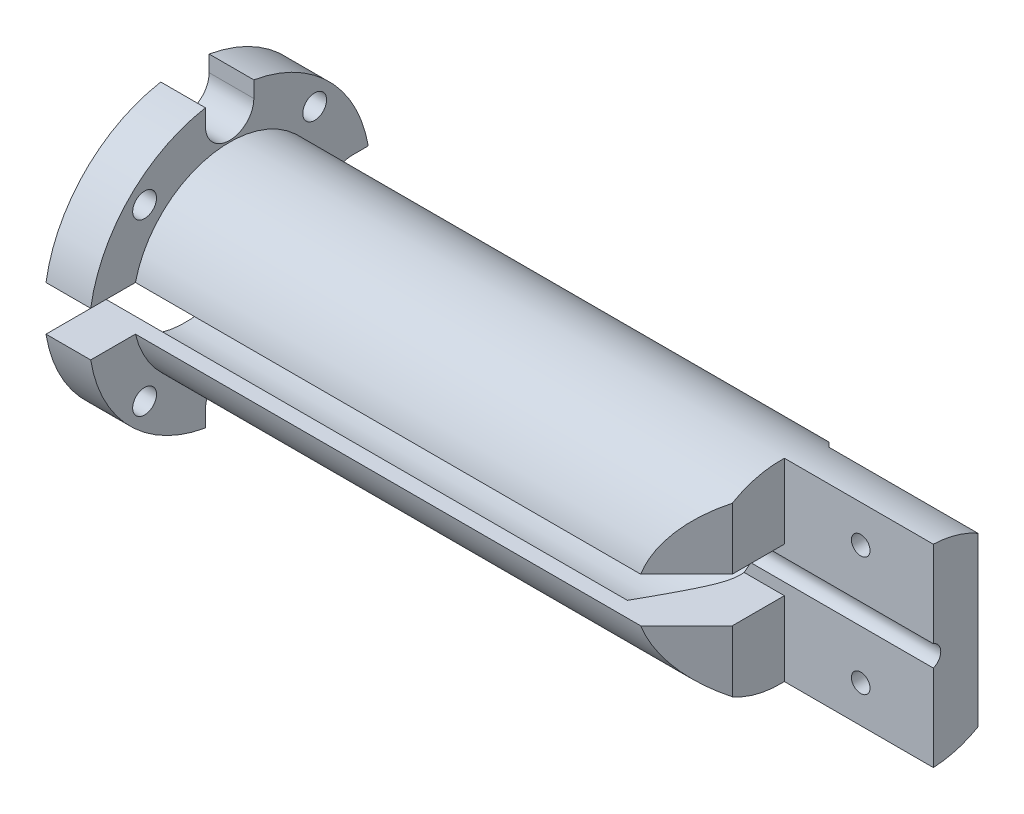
ISO-10303-21;
HEADER;
FILE_DESCRIPTION(('STEP AP214'),'2;1');
FILE_NAME('part.step','',(''),(''),'','','');
FILE_SCHEMA(('AUTOMOTIVE_DESIGN { 1 0 10303 214 1 1 1 1 }'));
ENDSEC;
DATA;
#1=APPLICATION_CONTEXT('core data for automotive mechanical design processes');
#2=APPLICATION_PROTOCOL_DEFINITION('international standard','automotive_design',2000,#1);
#3=PRODUCT_CONTEXT('',#1,'mechanical');
#4=PRODUCT('Part','Part','',(#3));
#5=PRODUCT_RELATED_PRODUCT_CATEGORY('part','',(#4));
#6=PRODUCT_DEFINITION_FORMATION('','',#4);
#7=PRODUCT_DEFINITION_CONTEXT('part definition',#1,'design');
#8=PRODUCT_DEFINITION('design','',#6,#7);
#9=PRODUCT_DEFINITION_SHAPE('','',#8);
#10=(LENGTH_UNIT() NAMED_UNIT(*) SI_UNIT(.MILLI.,.METRE.));
#11=(NAMED_UNIT(*) PLANE_ANGLE_UNIT() SI_UNIT($,.RADIAN.));
#12=(NAMED_UNIT(*) SI_UNIT($,.STERADIAN.) SOLID_ANGLE_UNIT());
#13=UNCERTAINTY_MEASURE_WITH_UNIT(LENGTH_MEASURE(1.E-05),#10,'distance_accuracy_value','');
#14=(GEOMETRIC_REPRESENTATION_CONTEXT(3) GLOBAL_UNCERTAINTY_ASSIGNED_CONTEXT((#13)) GLOBAL_UNIT_ASSIGNED_CONTEXT((#10,
#11,#12)) REPRESENTATION_CONTEXT('',''));
#15=CARTESIAN_POINT('',(0.,0.,0.));
#16=DIRECTION('',(0.,0.,1.));
#17=DIRECTION('',(1.,0.,0.));
#18=AXIS2_PLACEMENT_3D('',#15,#16,#17);
#19=CARTESIAN_POINT('',(100.,3.,-0.500000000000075));
#20=DIRECTION('',(0.,0.,-1.));
#21=DIRECTION('',(0.,1.00000000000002,0.));
#22=AXIS2_PLACEMENT_3D('',#19,#20,#21);
#23=PLANE('',#22);
#24=CARTESIAN_POINT('',(71.7935091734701,-7.87769935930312,-0.499999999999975));
#25=CARTESIAN_POINT('',(71.985277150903,-7.54486705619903,-0.500000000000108));
#26=CARTESIAN_POINT('',(72.1770181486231,-7.2120191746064,-0.500000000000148));
#27=CARTESIAN_POINT('',(72.5603887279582,-6.54625752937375,-0.500000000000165));
#28=CARTESIAN_POINT('',(72.7520183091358,-6.21334376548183,-0.500000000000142));
#29=CARTESIAN_POINT('',(73.1350008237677,-5.54760297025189,-0.500000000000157));
#30=CARTESIAN_POINT('',(73.3263538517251,-5.21477599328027,-0.500000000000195));
#31=CARTESIAN_POINT('',(73.7087695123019,-4.54895657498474,-0.50000000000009));
#32=CARTESIAN_POINT('',(73.8998321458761,-4.2159641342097,-0.499999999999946));
#33=CARTESIAN_POINT('',(74.1852074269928,-3.71759224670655,-0.50000000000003));
#34=CARTESIAN_POINT('',(74.2797393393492,-3.55233837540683,-0.500000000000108));
#35=CARTESIAN_POINT('',(74.4685857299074,-3.22170476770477,-0.500000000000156));
#36=CARTESIAN_POINT('',(74.562900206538,-3.05632503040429,-0.500000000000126));
#37=CARTESIAN_POINT('',(74.7512178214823,-2.72530581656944,-0.50000000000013));
#38=CARTESIAN_POINT('',(74.8452208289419,-2.55966626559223,-0.500000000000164));
#39=CARTESIAN_POINT('',(75.0326396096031,-2.22805865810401,-0.500000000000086));
#40=CARTESIAN_POINT('',(75.1260553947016,-2.06209060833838,-0.499999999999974));
#41=CARTESIAN_POINT('',(75.2653525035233,-1.81255900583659,-0.50000000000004));
#42=CARTESIAN_POINT('',(75.3116718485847,-1.72924016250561,-0.5000000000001));
#43=CARTESIAN_POINT('',(75.4038672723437,-1.56235150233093,-0.500000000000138));
#44=CARTESIAN_POINT('',(75.4497433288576,-1.47878167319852,-0.500000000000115));
#45=CARTESIAN_POINT('',(75.5407591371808,-1.31131721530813,-0.50000000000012));
#46=CARTESIAN_POINT('',(75.5858993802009,-1.22742285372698,-0.500000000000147));
#47=CARTESIAN_POINT('',(75.674997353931,-1.05901396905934,-0.500000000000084));
#48=CARTESIAN_POINT('',(75.7189552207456,-0.974499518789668,-0.499999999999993));
#49=CARTESIAN_POINT('',(75.7831611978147,-0.846902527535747,-0.500000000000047));
#50=CARTESIAN_POINT('',(75.8042652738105,-0.804252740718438,-0.500000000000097));
#51=CARTESIAN_POINT('',(75.8456294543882,-0.718547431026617,-0.500000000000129));
#52=CARTESIAN_POINT('',(75.8658896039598,-0.675491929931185,-0.500000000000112));
#53=CARTESIAN_POINT('',(75.9052209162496,-0.588637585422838,-0.500000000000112));
#54=CARTESIAN_POINT('',(75.9242873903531,-0.544836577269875,-0.500000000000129));
#55=CARTESIAN_POINT('',(75.9604047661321,-0.456429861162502,-0.500000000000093));
#56=CARTESIAN_POINT('',(75.9774562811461,-0.411824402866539,-0.500000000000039));
#57=CARTESIAN_POINT('',(76.0124317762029,-0.309390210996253,-0.500000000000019));
#58=CARTESIAN_POINT('',(76.0293839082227,-0.251196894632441,-0.500000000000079));
#59=CARTESIAN_POINT('',(76.0476849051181,-0.162701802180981,-0.500000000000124));
#60=CARTESIAN_POINT('',(76.0525902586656,-0.133154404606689,-0.500000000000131));
#61=CARTESIAN_POINT('',(76.059539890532,-0.0737242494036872,-0.500000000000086));
#62=CARTESIAN_POINT('',(76.0615854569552,-0.043841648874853,-0.500000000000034));
#63=CARTESIAN_POINT('',(76.0625501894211,0.0162315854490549,-0.500000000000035));
#64=CARTESIAN_POINT('',(76.0614425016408,0.0464226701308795,-0.500000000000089));
#65=CARTESIAN_POINT('',(76.0561979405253,0.106539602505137,-0.500000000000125));
#66=CARTESIAN_POINT('',(76.0520600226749,0.136465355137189,-0.500000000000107));
#67=CARTESIAN_POINT('',(76.0411922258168,0.196172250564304,-0.500000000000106));
#68=CARTESIAN_POINT('',(76.0344338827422,0.225948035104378,-0.500000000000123));
#69=CARTESIAN_POINT('',(76.0189316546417,0.284968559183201,-0.500000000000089));
#70=CARTESIAN_POINT('',(76.0101875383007,0.314213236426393,-0.500000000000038));
#71=CARTESIAN_POINT('',(75.9912756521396,0.372095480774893,-0.500000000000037));
#72=CARTESIAN_POINT('',(75.9811139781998,0.400735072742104,-0.500000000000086));
#73=CARTESIAN_POINT('',(75.959722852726,0.457615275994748,-0.500000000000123));
#74=CARTESIAN_POINT('',(75.9484931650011,0.485855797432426,-0.500000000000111));
#75=CARTESIAN_POINT('',(75.9136228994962,0.570143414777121,-0.500000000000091));
#76=CARTESIAN_POINT('',(75.8888188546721,0.625705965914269,-0.5000000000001));
#77=CARTESIAN_POINT('',(75.8374163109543,0.736141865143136,-0.500000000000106));
#78=CARTESIAN_POINT('',(75.8108135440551,0.791013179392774,-0.500000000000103));
#79=CARTESIAN_POINT('',(75.7565354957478,0.900227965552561,-0.500000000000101));
#80=CARTESIAN_POINT('',(75.728860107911,0.954571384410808,-0.500000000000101));
#81=CARTESIAN_POINT('',(75.6727512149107,1.06303558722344,-0.5000000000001));
#82=CARTESIAN_POINT('',(75.6443159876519,1.1171554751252,-0.500000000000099));
#83=CARTESIAN_POINT('',(75.5869703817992,1.22515129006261,-0.500000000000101));
#84=CARTESIAN_POINT('',(75.5580599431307,1.2790271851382,-0.500000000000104));
#85=CARTESIAN_POINT('',(75.4709460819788,1.4401909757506,-0.500000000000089));
#86=CARTESIAN_POINT('',(75.4122551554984,1.54721491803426,-0.500000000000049));
#87=CARTESIAN_POINT('',(75.294813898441,1.75970650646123,-0.500000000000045));
#88=CARTESIAN_POINT('',(75.2360712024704,1.8651783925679,-0.500000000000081));
#89=CARTESIAN_POINT('',(75.118156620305,2.07588241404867,-0.500000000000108));
#90=CARTESIAN_POINT('',(75.0589847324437,2.18111454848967,-0.500000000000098));
#91=CARTESIAN_POINT('',(74.8810579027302,2.49658663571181,-0.500000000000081));
#92=CARTESIAN_POINT('',(74.7618951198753,2.70659630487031,-0.500000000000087));
#93=CARTESIAN_POINT('',(74.5229615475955,3.12646262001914,-0.50000000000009));
#94=CARTESIAN_POINT('',(74.4031903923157,3.33631905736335,-0.500000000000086));
#95=CARTESIAN_POINT('',(74.1633440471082,3.75585476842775,-0.500000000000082));
#96=CARTESIAN_POINT('',(74.0432688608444,3.96553404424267,-0.500000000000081));
#97=CARTESIAN_POINT('',(73.8032937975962,4.38415148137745,-0.500000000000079));
#98=CARTESIAN_POINT('',(73.6833944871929,4.593089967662,-0.500000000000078));
#99=CARTESIAN_POINT('',(73.4434707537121,5.01089596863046,-0.500000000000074));
#100=CARTESIAN_POINT('',(73.3234463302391,5.21976348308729,-0.50000000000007));
#101=CARTESIAN_POINT('',(72.9632867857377,5.84622104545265,-0.500000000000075));
#102=CARTESIAN_POINT('',(72.7230242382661,6.26373782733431,-0.5000000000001));
#103=CARTESIAN_POINT('',(72.4252894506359,6.78086996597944,-0.500000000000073));
#104=CARTESIAN_POINT('',(72.367901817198,6.88053406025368,-0.500000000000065));
#105=CARTESIAN_POINT('',(72.2531154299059,7.07985950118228,-0.500000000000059));
#106=CARTESIAN_POINT('',(72.195716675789,7.17952084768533,-0.500000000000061));
#107=CARTESIAN_POINT('',(72.0808532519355,7.37893887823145,-0.500000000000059));
#108=CARTESIAN_POINT('',(72.0233885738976,7.47869555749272,-0.500000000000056));
#109=CARTESIAN_POINT('',(71.9084534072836,7.67820190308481,-0.50000000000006));
#110=CARTESIAN_POINT('',(71.8509829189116,7.77795156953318,-0.500000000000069));
#111=CARTESIAN_POINT('',(71.7935091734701,7.877699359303,-0.500000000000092));
#112=B_SPLINE_CURVE_WITH_KNOTS('',3,(#24,#25,#26,#27,#28,#29,#30,#31,#32,#33,#34,#35,#36,#37,
#38,#39,#40,#41,#42,#43,#44,#45,#46,#47,#48,#49,#50,#51,#52,#53,#54,#55,#56,#57,#58,#59,#60,#61,
#62,#63,#64,#65,#66,#67,#68,#69,#70,#71,#72,#73,#74,#75,#76,#77,#78,#79,#80,#81,#82,#83,#84,#85,
#86,#87,#88,#89,#90,#91,#92,#93,#94,#95,#96,#97,#98,#99,#100,#101,#102,#103,#104,#105,#106,#107,
#108,#109,#110,#111),.UNSPECIFIED.,.F.,.F.,(4,2,2,2,2,2,2,2,2,2,2,2,2,2,2,2,2,2,2,2,2,2,2,2,2,2,
2,2,2,2,2,2,2,2,2,2,2,2,2,2,2,2,2,4),(0.,1.15237615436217,2.30475680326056,3.4564980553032,
4.60823551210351,5.17938000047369,5.75052860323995,6.32189264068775,6.89324506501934,
7.1792296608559,7.46522849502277,7.7510278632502,8.03679419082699,8.17954417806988,
8.32228654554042,8.46555833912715,8.60878640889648,8.79006816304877,8.87980934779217,
8.9695100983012,9.05997704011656,9.1504751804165,9.24198520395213,9.33350589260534,
9.42464450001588,9.51580330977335,9.6982815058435,9.88120900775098,10.0641547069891,
10.2475577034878,10.4309840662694,10.7971594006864,11.1593395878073,11.5215211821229,
12.2459048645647,12.9707933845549,13.6956732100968,14.4183627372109,15.141054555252,
16.5861901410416,16.9312067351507,17.2762328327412,17.6216054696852,17.9669685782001),.UNSPECIFIED.);
#113=CARTESIAN_POINT('',(75.4848275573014,1.41421356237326,-0.500000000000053));
#114=VERTEX_POINT('',#113);
#115=CARTESIAN_POINT('',(74.5949106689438,3.00000000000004,-0.50000000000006));
#116=VERTEX_POINT('',#115);
#117=EDGE_CURVE('E599',#114,#116,#112,.T.);
#118=ORIENTED_EDGE('',*,*,#117,.F.);
#119=DIRECTION('',(-1.,0.,0.));
#120=VECTOR('',#119,1.);
#121=CARTESIAN_POINT('',(0.,1.41421356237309,-0.500000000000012));
#122=LINE('',#121,#120);
#123=CARTESIAN_POINT('',(100.,1.41421356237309,-0.500000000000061));
#124=VERTEX_POINT('',#123);
#125=EDGE_CURVE('E605',#124,#114,#122,.T.);
#126=ORIENTED_EDGE('',*,*,#125,.F.);
#127=DIRECTION('',(0.,-1.00000000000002,0.));
#128=VECTOR('',#127,1.);
#129=CARTESIAN_POINT('',(100.,3.,-0.500000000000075));
#130=LINE('',#129,#128);
#131=CARTESIAN_POINT('',(100.,12.9903810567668,-0.500000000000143));
#132=VERTEX_POINT('',#131);
#133=EDGE_CURVE('E348',#132,#124,#130,.T.);
#134=ORIENTED_EDGE('',*,*,#133,.F.);
#135=DIRECTION('',(-1.,0.,0.));
#136=VECTOR('',#135,1.);
#137=CARTESIAN_POINT('',(5.41233724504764E-13,12.9903810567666,-0.500000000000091));
#138=LINE('',#137,#136);
#139=CARTESIAN_POINT('',(80.,12.9903810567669,-0.500000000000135));
#140=VERTEX_POINT('',#139);
#141=EDGE_CURVE('E324',#140,#132,#138,.F.);
#142=ORIENTED_EDGE('',*,*,#141,.F.);
#143=DIRECTION('',(0.,-1.00000000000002,0.));
#144=VECTOR('',#143,1.);
#145=CARTESIAN_POINT('',(80.0000000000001,-13.,-0.49999999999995));
#146=LINE('',#145,#144);
#147=CARTESIAN_POINT('',(80.,3.00000000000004,-0.500000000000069));
#148=VERTEX_POINT('',#147);
#149=EDGE_CURVE('E314',#140,#148,#146,.T.);
#150=ORIENTED_EDGE('',*,*,#149,.T.);
#151=DIRECTION('',(-1.,0.,0.));
#152=VECTOR('',#151,1.);
#153=CARTESIAN_POINT('',(100.,3.,-0.500000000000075));
#154=LINE('',#153,#152);
#155=EDGE_CURVE('E351',#148,#116,#154,.T.);
#156=ORIENTED_EDGE('',*,*,#155,.T.);
#157=EDGE_LOOP('',(#118,#126,#134,#142,#150,#156));
#158=FACE_BOUND('',#157,.T.);
#159=CARTESIAN_POINT('',(90.25,8.00000000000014,-0.500000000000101));
#160=DIRECTION('',(0.,0.,1.));
#161=DIRECTION('',(1.,0.,0.));
#162=AXIS2_PLACEMENT_3D('',#159,#160,#161);
#163=CIRCLE('',#162,1.24999999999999);
#164=CARTESIAN_POINT('',(91.5,8.00000000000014,-0.500000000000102));
#165=VERTEX_POINT('',#164);
#166=EDGE_CURVE('E545',#165,#165,#163,.T.);
#167=ORIENTED_EDGE('',*,*,#166,.F.);
#168=EDGE_LOOP('',(#167));
#169=FACE_BOUND('',#168,.T.);
#170=ADVANCED_FACE('F36',(#158,#169),#23,.F.);
#171=CARTESIAN_POINT('',(5.41233724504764E-13,18.9,-1.32195805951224E-13));
#172=DIRECTION('',(1.,0.,0.));
#173=DIRECTION('',(0.,0.,-1.));
#174=AXIS2_PLACEMENT_3D('',#171,#172,#173);
#175=PLANE('',#174);
#176=CARTESIAN_POINT('',(0.,-11.4197745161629,11.4197745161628));
#177=DIRECTION('',(-1.,0.,0.));
#178=DIRECTION('',(0.,0.,1.));
#179=AXIS2_PLACEMENT_3D('',#176,#177,#178);
#180=CIRCLE('',#179,1.59999999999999);
#181=CARTESIAN_POINT('',(0.,-11.4197745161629,13.0197745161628));
#182=VERTEX_POINT('',#181);
#183=EDGE_CURVE('E559',#182,#182,#180,.T.);
#184=ORIENTED_EDGE('',*,*,#183,.F.);
#185=EDGE_LOOP('',(#184));
#186=FACE_BOUND('',#185,.T.);
#187=CARTESIAN_POINT('',(1.94289029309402E-13,11.419774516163,-11.4197745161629));
#188=DIRECTION('',(-1.,0.,0.));
#189=DIRECTION('',(0.,0.,1.));
#190=AXIS2_PLACEMENT_3D('',#187,#188,#189);
#191=CIRCLE('',#190,1.59999999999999);
#192=CARTESIAN_POINT('',(1.93464585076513E-13,11.419774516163,-9.8197745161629));
#193=VERTEX_POINT('',#192);
#194=EDGE_CURVE('E249',#193,#193,#191,.T.);
#195=ORIENTED_EDGE('',*,*,#194,.F.);
#196=EDGE_LOOP('',(#195));
#197=FACE_BOUND('',#196,.T.);
#198=CARTESIAN_POINT('',(5.41233724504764E-13,16.45,0.));
#199=DIRECTION('',(-1.,0.,0.));
#200=DIRECTION('',(0.,0.,-1.));
#201=AXIS2_PLACEMENT_3D('',#198,#199,#200);
#202=CIRCLE('',#201,3.25);
#203=CARTESIAN_POINT('',(5.41233724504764E-13,16.45,-3.24999999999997));
#204=VERTEX_POINT('',#203);
#205=CARTESIAN_POINT('',(5.41233724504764E-13,16.45,3.25000000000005));
#206=VERTEX_POINT('',#205);
#207=EDGE_CURVE('E229',#204,#206,#202,.T.);
#208=ORIENTED_EDGE('',*,*,#207,.F.);
#209=DIRECTION('',(0.,-1.00000000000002,0.));
#210=VECTOR('',#209,1.);
#211=CARTESIAN_POINT('',(5.41233724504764E-13,16.45,-3.24999999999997));
#212=LINE('',#211,#210);
#213=CARTESIAN_POINT('',(5.41233724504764E-13,18.618472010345,-3.24999999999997));
#214=VERTEX_POINT('',#213);
#215=EDGE_CURVE('E231',#214,#204,#212,.T.);
#216=ORIENTED_EDGE('',*,*,#215,.F.);
#217=CARTESIAN_POINT('',(0.,0.,0.));
#218=DIRECTION('',(-1.,0.,0.));
#219=DIRECTION('',(0.,0.,1.));
#220=AXIS2_PLACEMENT_3D('',#217,#218,#219);
#221=CIRCLE('',#220,18.9);
#222=CARTESIAN_POINT('',(0.,3.25000000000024,-18.6184720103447));
#223=VERTEX_POINT('',#222);
#224=EDGE_CURVE('E59',#214,#223,#221,.T.);
#225=ORIENTED_EDGE('',*,*,#224,.T.);
#226=DIRECTION('',(0.,0.,-1.));
#227=VECTOR('',#226,1.);
#228=CARTESIAN_POINT('',(0.,3.25000000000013,-16.4499999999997));
#229=LINE('',#228,#227);
#230=CARTESIAN_POINT('',(0.,3.25000000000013,-16.4499999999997));
#231=VERTEX_POINT('',#230);
#232=EDGE_CURVE('E268',#231,#223,#229,.T.);
#233=ORIENTED_EDGE('',*,*,#232,.F.);
#234=CARTESIAN_POINT('',(0.,2.39391839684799E-13,-16.4499999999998));
#235=DIRECTION('',(-1.,0.,0.));
#236=DIRECTION('',(0.,-1.00000000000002,0.));
#237=AXIS2_PLACEMENT_3D('',#234,#235,#236);
#238=CIRCLE('',#237,3.25);
#239=CARTESIAN_POINT('',(0.,-3.24999999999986,-16.4499999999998));
#240=VERTEX_POINT('',#239);
#241=EDGE_CURVE('E265',#240,#231,#238,.T.);
#242=ORIENTED_EDGE('',*,*,#241,.F.);
#243=DIRECTION('',(0.,0.,1.));
#244=VECTOR('',#243,1.);
#245=CARTESIAN_POINT('',(0.,-3.24999999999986,-16.4499999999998));
#246=LINE('',#245,#244);
#247=CARTESIAN_POINT('',(0.,-3.24999999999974,-18.6184720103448));
#248=VERTEX_POINT('',#247);
#249=EDGE_CURVE('E270',#248,#240,#246,.T.);
#250=ORIENTED_EDGE('',*,*,#249,.F.);
#251=CARTESIAN_POINT('',(0.,-18.6184720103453,-3.24999999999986));
#252=VERTEX_POINT('',#251);
#253=EDGE_CURVE('E592',#248,#252,#221,.T.);
#254=ORIENTED_EDGE('',*,*,#253,.T.);
#255=DIRECTION('',(0.,-1.00000000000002,0.));
#256=VECTOR('',#255,1.);
#257=CARTESIAN_POINT('',(0.,-16.4500000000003,-3.24999999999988));
#258=LINE('',#257,#256);
#259=CARTESIAN_POINT('',(0.,-16.4500000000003,-3.24999999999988));
#260=VERTEX_POINT('',#259);
#261=EDGE_CURVE('E293',#260,#252,#258,.T.);
#262=ORIENTED_EDGE('',*,*,#261,.F.);
#263=CARTESIAN_POINT('',(1.94289029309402E-13,-16.4500000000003,1.15061069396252E-13));
#264=DIRECTION('',(-1.,0.,0.));
#265=DIRECTION('',(0.,0.,1.));
#266=AXIS2_PLACEMENT_3D('',#263,#264,#265);
#267=CIRCLE('',#266,3.25);
#268=CARTESIAN_POINT('',(1.94289029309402E-13,-16.4500000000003,3.25000000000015));
#269=VERTEX_POINT('',#268);
#270=EDGE_CURVE('E290',#269,#260,#267,.T.);
#271=ORIENTED_EDGE('',*,*,#270,.F.);
#272=DIRECTION('',(0.,1.00000000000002,0.));
#273=VECTOR('',#272,1.);
#274=CARTESIAN_POINT('',(1.94289029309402E-13,-16.4500000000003,3.25000000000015));
#275=LINE('',#274,#273);
#276=CARTESIAN_POINT('',(0.,-18.6184720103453,3.25000000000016));
#277=VERTEX_POINT('',#276);
#278=EDGE_CURVE('E296',#277,#269,#275,.T.);
#279=ORIENTED_EDGE('',*,*,#278,.F.);
#280=CARTESIAN_POINT('',(5.41233724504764E-13,-3.00000000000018,18.6603858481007));
#281=VERTEX_POINT('',#280);
#282=EDGE_CURVE('E588',#277,#281,#221,.T.);
#283=ORIENTED_EDGE('',*,*,#282,.T.);
#284=DIRECTION('',(0.,0.,1.));
#285=VECTOR('',#284,1.);
#286=CARTESIAN_POINT('',(0.,-3.,-0.499999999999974));
#287=LINE('',#286,#285);
#288=CARTESIAN_POINT('',(5.41233724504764E-13,-3.00000000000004,10.5830052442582));
#289=VERTEX_POINT('',#288);
#290=EDGE_CURVE('E354',#289,#281,#287,.T.);
#291=ORIENTED_EDGE('',*,*,#290,.F.);
#292=CARTESIAN_POINT('',(0.,0.,0.));
#293=DIRECTION('',(-1.,0.,0.));
#294=DIRECTION('',(0.,0.,1.));
#295=AXIS2_PLACEMENT_3D('',#292,#293,#294);
#296=CIRCLE('',#295,11.);
#297=CARTESIAN_POINT('',(7.35522753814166E-13,2.99999999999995,10.5830052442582));
#298=VERTEX_POINT('',#297);
#299=EDGE_CURVE('E613',#298,#289,#296,.T.);
#300=ORIENTED_EDGE('',*,*,#299,.F.);
#301=DIRECTION('',(0.,0.,-1.));
#302=VECTOR('',#301,1.);
#303=CARTESIAN_POINT('',(1.41553435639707E-12,2.99999999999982,18.6603858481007));
#304=LINE('',#303,#302);
#305=CARTESIAN_POINT('',(1.41553435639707E-12,2.99999999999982,18.6603858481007));
#306=VERTEX_POINT('',#305);
#307=EDGE_CURVE('E344',#306,#298,#304,.T.);
#308=ORIENTED_EDGE('',*,*,#307,.F.);
#309=CARTESIAN_POINT('',(5.41233724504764E-13,18.618472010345,3.25000000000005));
#310=VERTEX_POINT('',#309);
#311=EDGE_CURVE('E583',#306,#310,#221,.T.);
#312=ORIENTED_EDGE('',*,*,#311,.T.);
#313=DIRECTION('',(0.,1.00000000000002,0.));
#314=VECTOR('',#313,1.);
#315=CARTESIAN_POINT('',(5.41233724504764E-13,16.45,3.25000000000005));
#316=LINE('',#315,#314);
#317=EDGE_CURVE('E51',#206,#310,#316,.T.);
#318=ORIENTED_EDGE('',*,*,#317,.F.);
#319=EDGE_LOOP('',(#208,#216,#225,#233,#242,#250,#254,#262,#271,#279,#283,#291,#300,#308,#312,#318));
#320=FACE_BOUND('',#319,.T.);
#321=CARTESIAN_POINT('',(7.35522753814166E-13,-11.4197745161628,-11.4197745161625));
#322=DIRECTION('',(-1.,0.,0.));
#323=DIRECTION('',(0.,0.,1.));
#324=AXIS2_PLACEMENT_3D('',#321,#322,#323);
#325=CIRCLE('',#324,1.59999999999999);
#326=CARTESIAN_POINT('',(7.34698309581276E-13,-11.4197745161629,-9.81977451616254));
#327=VERTEX_POINT('',#326);
#328=EDGE_CURVE('E565',#327,#327,#325,.T.);
#329=ORIENTED_EDGE('',*,*,#328,.F.);
#330=EDGE_LOOP('',(#329));
#331=FACE_BOUND('',#330,.T.);
#332=CARTESIAN_POINT('',(0.,11.419774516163,11.4197745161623));
#333=DIRECTION('',(-1.,0.,0.));
#334=DIRECTION('',(0.,0.,1.));
#335=AXIS2_PLACEMENT_3D('',#332,#333,#334);
#336=CIRCLE('',#335,1.59999999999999);
#337=CARTESIAN_POINT('',(0.,11.419774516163,13.0197745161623));
#338=VERTEX_POINT('',#337);
#339=EDGE_CURVE('E553',#338,#338,#336,.T.);
#340=ORIENTED_EDGE('',*,*,#339,.F.);
#341=EDGE_LOOP('',(#340));
#342=FACE_BOUND('',#341,.T.);
#343=ADVANCED_FACE('F38',(#186,#197,#320,#331,#342),#175,.F.);
#344=CARTESIAN_POINT('',(0.,0.,0.));
#345=DIRECTION('',(-1.,0.,0.));
#346=DIRECTION('',(0.,0.,1.));
#347=AXIS2_PLACEMENT_3D('',#344,#345,#346);
#348=CYLINDRICAL_SURFACE('',#347,18.9);
#349=ORIENTED_EDGE('',*,*,#224,.F.);
#350=DIRECTION('',(-1.,0.,0.));
#351=VECTOR('',#350,1.);
#352=CARTESIAN_POINT('',(100.001,18.6184720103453,-3.25000000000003));
#353=LINE('',#352,#351);
#354=CARTESIAN_POINT('',(6.00000000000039,18.6184720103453,-3.24999999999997));
#355=VERTEX_POINT('',#354);
#356=EDGE_CURVE('E258',#355,#214,#353,.T.);
#357=ORIENTED_EDGE('',*,*,#356,.F.);
#358=CARTESIAN_POINT('',(6.00000000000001,0.,0.));
#359=DIRECTION('',(-1.,0.,0.));
#360=DIRECTION('',(0.,0.,1.));
#361=AXIS2_PLACEMENT_3D('',#358,#359,#360);
#362=CIRCLE('',#361,18.9);
#363=CARTESIAN_POINT('',(6.00000000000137,3.25000000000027,-18.6184720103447));
#364=VERTEX_POINT('',#363);
#365=EDGE_CURVE('E653',#355,#364,#362,.T.);
#366=ORIENTED_EDGE('',*,*,#365,.T.);
#367=DIRECTION('',(-1.,0.,0.));
#368=VECTOR('',#367,1.);
#369=CARTESIAN_POINT('',(100.001,3.25000000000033,-18.6184720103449));
#370=LINE('',#369,#368);
#371=EDGE_CURVE('E279',#364,#223,#370,.T.);
#372=ORIENTED_EDGE('',*,*,#371,.T.);
#373=EDGE_LOOP('',(#349,#357,#366,#372));
#374=FACE_BOUND('',#373,.T.);
#375=ADVANCED_FACE('F394',(#374),#348,.T.);
#376=ORIENTED_EDGE('',*,*,#253,.F.);
#377=DIRECTION('',(-1.,0.,0.));
#378=VECTOR('',#377,1.);
#379=CARTESIAN_POINT('',(100.001,-3.24999999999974,-18.6184720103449));
#380=LINE('',#379,#378);
#381=CARTESIAN_POINT('',(6.00000000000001,-3.24999999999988,-18.6184720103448));
#382=VERTEX_POINT('',#381);
#383=EDGE_CURVE('E277',#382,#248,#380,.T.);
#384=ORIENTED_EDGE('',*,*,#383,.F.);
#385=CARTESIAN_POINT('',(6.00000000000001,-18.6184720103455,-3.24999999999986));
#386=VERTEX_POINT('',#385);
#387=EDGE_CURVE('E589',#382,#386,#362,.T.);
#388=ORIENTED_EDGE('',*,*,#387,.T.);
#389=DIRECTION('',(-1.,0.,0.));
#390=VECTOR('',#389,1.);
#391=CARTESIAN_POINT('',(100.001,-18.6184720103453,-3.24999999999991));
#392=LINE('',#391,#390);
#393=EDGE_CURVE('E305',#386,#252,#392,.T.);
#394=ORIENTED_EDGE('',*,*,#393,.T.);
#395=EDGE_LOOP('',(#376,#384,#388,#394));
#396=FACE_BOUND('',#395,.T.);
#397=ADVANCED_FACE('F662',(#396),#348,.T.);
#398=ORIENTED_EDGE('',*,*,#282,.F.);
#399=DIRECTION('',(-1.,0.,0.));
#400=VECTOR('',#399,1.);
#401=CARTESIAN_POINT('',(100.001,-18.6184720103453,3.2500000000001));
#402=LINE('',#401,#400);
#403=CARTESIAN_POINT('',(6.00000000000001,-18.6184720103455,3.25000000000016));
#404=VERTEX_POINT('',#403);
#405=EDGE_CURVE('E303',#404,#277,#402,.T.);
#406=ORIENTED_EDGE('',*,*,#405,.F.);
#407=CARTESIAN_POINT('',(6.00000000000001,-3.00000000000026,18.6603858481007));
#408=VERTEX_POINT('',#407);
#409=EDGE_CURVE('E586',#404,#408,#362,.T.);
#410=ORIENTED_EDGE('',*,*,#409,.T.);
#411=DIRECTION('',(-1.,0.,0.));
#412=VECTOR('',#411,1.);
#413=CARTESIAN_POINT('',(5.41233724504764E-13,-3.00000000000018,18.6603858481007));
#414=LINE('',#413,#412);
#415=EDGE_CURVE('E624',#408,#281,#414,.T.);
#416=ORIENTED_EDGE('',*,*,#415,.T.);
#417=EDGE_LOOP('',(#398,#406,#410,#416));
#418=FACE_BOUND('',#417,.T.);
#419=ADVANCED_FACE('F395',(#418),#348,.T.);
#420=CARTESIAN_POINT('',(100.,1.5,0.));
#421=DIRECTION('',(-1.,0.,0.));
#422=DIRECTION('',(0.,0.,1.));
#423=AXIS2_PLACEMENT_3D('',#420,#421,#422);
#424=PLANE('',#423);
#425=CARTESIAN_POINT('',(100.,0.,0.));
#426=DIRECTION('',(-1.,0.,0.));
#427=DIRECTION('',(0.,0.,1.));
#428=AXIS2_PLACEMENT_3D('',#425,#426,#427);
#429=CIRCLE('',#428,13.);
#430=CARTESIAN_POINT('',(100.,11.258330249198,-6.50000000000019));
#431=VERTEX_POINT('',#430);
#432=EDGE_CURVE('E641',#132,#431,#429,.T.);
#433=ORIENTED_EDGE('',*,*,#432,.F.);
#434=ORIENTED_EDGE('',*,*,#133,.T.);
#435=CARTESIAN_POINT('',(100.,0.,0.));
#436=DIRECTION('',(-1.,0.,0.));
#437=DIRECTION('',(0.,0.,1.));
#438=AXIS2_PLACEMENT_3D('',#435,#436,#437);
#439=CIRCLE('',#438,1.5);
#440=CARTESIAN_POINT('',(100.,-1.4142135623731,-0.500000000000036));
#441=VERTEX_POINT('',#440);
#442=EDGE_CURVE('E619',#124,#441,#439,.T.);
#443=ORIENTED_EDGE('',*,*,#442,.T.);
#444=CARTESIAN_POINT('',(100.,-12.9903810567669,-0.499999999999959));
#445=VERTEX_POINT('',#444);
#446=EDGE_CURVE('E352',#441,#445,#130,.T.);
#447=ORIENTED_EDGE('',*,*,#446,.T.);
#448=CARTESIAN_POINT('',(100.,-11.258330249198,-6.50000000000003));
#449=VERTEX_POINT('',#448);
#450=EDGE_CURVE('E635',#449,#445,#429,.T.);
#451=ORIENTED_EDGE('',*,*,#450,.F.);
#452=DIRECTION('',(0.,1.00000000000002,0.));
#453=VECTOR('',#452,1.);
#454=CARTESIAN_POINT('',(100.,-18.9000000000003,-6.49999999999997));
#455=LINE('',#454,#453);
#456=EDGE_CURVE('E341',#449,#431,#455,.T.);
#457=ORIENTED_EDGE('',*,*,#456,.T.);
#458=EDGE_LOOP('',(#433,#434,#443,#447,#451,#457));
#459=FACE_BOUND('',#458,.T.);
#460=ADVANCED_FACE('F402',(#459),#424,.F.);
#461=CARTESIAN_POINT('',(0.,0.,0.));
#462=DIRECTION('',(-1.,0.,0.));
#463=DIRECTION('',(0.,0.,1.));
#464=AXIS2_PLACEMENT_3D('',#461,#462,#463);
#465=CYLINDRICAL_SURFACE('',#464,13.);
#466=CARTESIAN_POINT('',(80.,-1.35308431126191E-13,0.));
#467=DIRECTION('',(-1.,0.,0.));
#468=DIRECTION('',(0.,0.,1.));
#469=AXIS2_PLACEMENT_3D('',#466,#467,#468);
#470=CIRCLE('',#469,13.);
#471=CARTESIAN_POINT('',(80.,11.2583302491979,6.49999999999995));
#472=VERTEX_POINT('',#471);
#473=EDGE_CURVE('E322',#472,#140,#470,.T.);
#474=ORIENTED_EDGE('',*,*,#473,.T.);
#475=ORIENTED_EDGE('',*,*,#141,.T.);
#476=ORIENTED_EDGE('',*,*,#432,.T.);
#477=DIRECTION('',(-1.,0.,0.));
#478=VECTOR('',#477,1.);
#479=CARTESIAN_POINT('',(1.41553435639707E-12,11.258330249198,-6.50000000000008));
#480=LINE('',#479,#478);
#481=CARTESIAN_POINT('',(80.,11.2583302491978,-6.5000000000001));
#482=VERTEX_POINT('',#481);
#483=EDGE_CURVE('E629',#431,#482,#480,.T.);
#484=ORIENTED_EDGE('',*,*,#483,.T.);
#485=CARTESIAN_POINT('',(86.5,1.70002900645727E-13,0.));
#486=DIRECTION('',(-0.707106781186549,0.,0.707106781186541));
#487=DIRECTION('',(-0.707106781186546,0.,-0.707106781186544));
#488=AXIS2_PLACEMENT_3D('',#485,#486,#487);
#489=ELLIPSE('',#488,18.3847763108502,13.);
#490=CARTESIAN_POINT('',(80.0000000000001,-11.2583302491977,-6.49999999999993));
#491=VERTEX_POINT('',#490);
#492=EDGE_CURVE('E627',#482,#491,#489,.T.);
#493=ORIENTED_EDGE('',*,*,#492,.T.);
#494=DIRECTION('',(-1.,0.,0.));
#495=VECTOR('',#494,1.);
#496=CARTESIAN_POINT('',(8.74300631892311E-13,-11.2583302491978,-6.49999999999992));
#497=LINE('',#496,#495);
#498=EDGE_CURVE('E44',#491,#449,#497,.F.);
#499=ORIENTED_EDGE('',*,*,#498,.T.);
#500=ORIENTED_EDGE('',*,*,#450,.T.);
#501=DIRECTION('',(-1.,0.,0.));
#502=VECTOR('',#501,1.);
#503=CARTESIAN_POINT('',(8.74300631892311E-13,-12.9903810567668,-0.499999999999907));
#504=LINE('',#503,#502);
#505=CARTESIAN_POINT('',(80.0000000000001,-12.9903810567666,-0.49999999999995));
#506=VERTEX_POINT('',#505);
#507=EDGE_CURVE('E327',#445,#506,#504,.T.);
#508=ORIENTED_EDGE('',*,*,#507,.T.);
#509=CARTESIAN_POINT('',(80.,-11.2583302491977,6.5000000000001));
#510=VERTEX_POINT('',#509);
#511=EDGE_CURVE('E321',#506,#510,#470,.T.);
#512=ORIENTED_EDGE('',*,*,#511,.T.);
#513=CARTESIAN_POINT('',(86.5,1.70002900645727E-13,0.));
#514=DIRECTION('',(0.707106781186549,0.,0.707106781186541));
#515=DIRECTION('',(-0.707106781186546,0.,0.707106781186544));
#516=AXIS2_PLACEMENT_3D('',#513,#514,#515);
#517=ELLIPSE('',#516,18.3847763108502,13.);
#518=CARTESIAN_POINT('',(73.8508893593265,-3.00000000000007,12.6491106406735));
#519=VERTEX_POINT('',#518);
#520=EDGE_CURVE('E334',#519,#510,#517,.T.);
#521=ORIENTED_EDGE('',*,*,#520,.F.);
#522=DIRECTION('',(-1.,0.,0.));
#523=VECTOR('',#522,1.);
#524=CARTESIAN_POINT('',(5.41233724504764E-13,-3.00000000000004,12.6491106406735));
#525=LINE('',#524,#523);
#526=CARTESIAN_POINT('',(6.00000000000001,-3.00000000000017,12.6491106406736));
#527=VERTEX_POINT('',#526);
#528=EDGE_CURVE('E454',#519,#527,#525,.T.);
#529=ORIENTED_EDGE('',*,*,#528,.T.);
#530=CARTESIAN_POINT('',(6.00000000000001,0.,0.));
#531=DIRECTION('',(-1.,0.,0.));
#532=DIRECTION('',(0.,0.,1.));
#533=AXIS2_PLACEMENT_3D('',#530,#531,#532);
#534=CIRCLE('',#533,13.);
#535=CARTESIAN_POINT('',(6.00000000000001,2.99999999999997,12.6491106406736));
#536=VERTEX_POINT('',#535);
#537=EDGE_CURVE('E642',#536,#527,#534,.T.);
#538=ORIENTED_EDGE('',*,*,#537,.F.);
#539=DIRECTION('',(-1.,0.,0.));
#540=VECTOR('',#539,1.);
#541=CARTESIAN_POINT('',(7.35522753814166E-13,2.99999999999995,12.6491106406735));
#542=LINE('',#541,#540);
#543=CARTESIAN_POINT('',(73.8508893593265,2.99999999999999,12.6491106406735));
#544=VERTEX_POINT('',#543);
#545=EDGE_CURVE('E363',#536,#544,#542,.F.);
#546=ORIENTED_EDGE('',*,*,#545,.T.);
#547=EDGE_CURVE('E338',#472,#544,#517,.T.);
#548=ORIENTED_EDGE('',*,*,#547,.F.);
#549=EDGE_LOOP('',(#474,#475,#476,#484,#493,#499,#500,#508,#512,#521,#529,#538,#546,#548));
#550=FACE_BOUND('',#549,.T.);
#551=ADVANCED_FACE('F385',(#550),#465,.T.);
#552=CARTESIAN_POINT('',(100.,2.99999999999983,18.6603858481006));
#553=DIRECTION('',(0.,1.00000000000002,0.));
#554=DIRECTION('',(0.,0.,1.));
#555=AXIS2_PLACEMENT_3D('',#552,#553,#554);
#556=PLANE('',#555);
#557=ORIENTED_EDGE('',*,*,#155,.F.);
#558=DIRECTION('',(0.,0.,1.));
#559=VECTOR('',#558,1.);
#560=CARTESIAN_POINT('',(80.,2.99999999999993,18.6603858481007));
#561=LINE('',#560,#559);
#562=CARTESIAN_POINT('',(80.,3.,6.49999999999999));
#563=VERTEX_POINT('',#562);
#564=EDGE_CURVE('E318',#148,#563,#561,.T.);
#565=ORIENTED_EDGE('',*,*,#564,.T.);
#566=DIRECTION('',(0.707106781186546,0.,-0.707106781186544));
#567=VECTOR('',#566,1.);
#568=CARTESIAN_POINT('',(83.9198070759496,2.99999999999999,2.58019292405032));
#569=LINE('',#568,#567);
#570=EDGE_CURVE('E337',#544,#563,#569,.T.);
#571=ORIENTED_EDGE('',*,*,#570,.F.);
#572=ORIENTED_EDGE('',*,*,#545,.F.);
#573=DIRECTION('',(0.,0.,-1.));
#574=VECTOR('',#573,1.);
#575=CARTESIAN_POINT('',(6.00000000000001,3.,0.));
#576=LINE('',#575,#574);
#577=CARTESIAN_POINT('',(6.00000000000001,2.99999999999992,18.6603858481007));
#578=VERTEX_POINT('',#577);
#579=EDGE_CURVE('E359',#578,#536,#576,.T.);
#580=ORIENTED_EDGE('',*,*,#579,.F.);
#581=DIRECTION('',(-1.,0.,0.));
#582=VECTOR('',#581,1.);
#583=CARTESIAN_POINT('',(1.41553435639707E-12,2.99999999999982,18.6603858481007));
#584=LINE('',#583,#582);
#585=EDGE_CURVE('E617',#306,#578,#584,.F.);
#586=ORIENTED_EDGE('',*,*,#585,.F.);
#587=ORIENTED_EDGE('',*,*,#307,.T.);
#588=DIRECTION('',(-1.,0.,0.));
#589=VECTOR('',#588,1.);
#590=CARTESIAN_POINT('',(7.35522753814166E-13,2.99999999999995,10.5830052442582));
#591=LINE('',#590,#589);
#592=CARTESIAN_POINT('',(70.,2.99999999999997,10.5830052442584));
#593=VERTEX_POINT('',#592);
#594=EDGE_CURVE('E374',#593,#298,#591,.T.);
#595=ORIENTED_EDGE('',*,*,#594,.F.);
#596=CARTESIAN_POINT('',(72.0355400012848,3.00000000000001,-6.84585844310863));
#597=CARTESIAN_POINT('',(72.1270896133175,2.99999999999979,-6.6727058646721));
#598=CARTESIAN_POINT('',(72.2182237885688,2.99999999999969,-6.49933163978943));
#599=CARTESIAN_POINT('',(72.3994152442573,2.99999999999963,-6.1520087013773));
#600=CARTESIAN_POINT('',(72.4894724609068,2.99999999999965,-5.97805995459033));
#601=CARTESIAN_POINT('',(72.668451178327,2.99999999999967,-5.62909100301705));
#602=CARTESIAN_POINT('',(72.7573697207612,2.99999999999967,-5.45406927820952));
#603=CARTESIAN_POINT('',(72.9335018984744,2.99999999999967,-5.10317434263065));
#604=CARTESIAN_POINT('',(73.0207155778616,2.99999999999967,-4.92730115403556));
#605=CARTESIAN_POINT('',(73.200286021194,2.99999999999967,-4.55946084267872));
#606=CARTESIAN_POINT('',(73.2924483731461,2.99999999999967,-4.36739849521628));
#607=CARTESIAN_POINT('',(73.473304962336,2.99999999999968,-3.98164931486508));
#608=CARTESIAN_POINT('',(73.5619993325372,2.9999999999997,-3.78796254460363));
#609=CARTESIAN_POINT('',(73.7345767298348,2.99999999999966,-3.39857252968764));
#610=CARTESIAN_POINT('',(73.8184624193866,2.99999999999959,-3.20287047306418));
#611=CARTESIAN_POINT('',(73.979522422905,2.99999999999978,-2.8087384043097));
#612=CARTESIAN_POINT('',(74.0566980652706,3.00000000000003,-2.61030894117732));
#613=CARTESIAN_POINT('',(74.206186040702,3.00000000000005,-2.19692837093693));
#614=CARTESIAN_POINT('',(74.2778564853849,2.99999999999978,-1.98174153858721));
#615=CARTESIAN_POINT('',(74.4051927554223,2.9999999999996,-1.54654482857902));
#616=CARTESIAN_POINT('',(74.4608637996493,2.99999999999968,-1.32653654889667));
#617=CARTESIAN_POINT('',(74.5267623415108,2.9999999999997,-0.996101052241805));
#618=CARTESIAN_POINT('',(74.545647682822,2.99999999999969,-0.887395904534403));
#619=CARTESIAN_POINT('',(74.5772920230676,2.9999999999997,-0.669107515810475));
#620=CARTESIAN_POINT('',(74.5900524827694,2.99999999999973,-0.559524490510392));
#621=CARTESIAN_POINT('',(74.6088518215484,2.99999999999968,-0.339840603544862));
#622=CARTESIAN_POINT('',(74.6148946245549,2.99999999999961,-0.229740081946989));
#623=CARTESIAN_POINT('',(74.6199598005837,2.9999999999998,-0.0093789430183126));
#624=CARTESIAN_POINT('',(74.6189825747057,3.00000000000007,0.100881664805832));
#625=CARTESIAN_POINT('',(74.6108429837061,3.00000000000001,0.301887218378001));
#626=CARTESIAN_POINT('',(74.6047900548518,2.99999999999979,0.3926791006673));
#627=CARTESIAN_POINT('',(74.5881563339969,2.99999999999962,0.573850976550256));
#628=CARTESIAN_POINT('',(74.5775749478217,2.99999999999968,0.664230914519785));
#629=CARTESIAN_POINT('',(74.5395138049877,2.99999999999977,0.934527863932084));
#630=CARTESIAN_POINT('',(74.5057180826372,2.99999999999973,1.11358022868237));
#631=CARTESIAN_POINT('',(74.4446693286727,2.99999999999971,1.38112122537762));
#632=CARTESIAN_POINT('',(74.4223812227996,2.99999999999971,1.47081481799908));
#633=CARTESIAN_POINT('',(74.3748057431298,2.99999999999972,1.64941030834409));
#634=CARTESIAN_POINT('',(74.3495183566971,2.99999999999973,1.73831220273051));
#635=CARTESIAN_POINT('',(74.2963668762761,2.9999999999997,1.91532220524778));
#636=CARTESIAN_POINT('',(74.2685031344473,2.99999999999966,2.00343042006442));
#637=CARTESIAN_POINT('',(74.2105665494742,2.99999999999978,2.17890988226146));
#638=CARTESIAN_POINT('',(74.1804938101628,2.99999999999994,2.26628116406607));
#639=CARTESIAN_POINT('',(74.0817477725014,3.00000000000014,2.54341667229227));
#640=CARTESIAN_POINT('',(74.0095329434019,2.99999999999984,2.73191975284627));
#641=CARTESIAN_POINT('',(73.8587551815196,2.99999999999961,3.106383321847));
#642=CARTESIAN_POINT('',(73.7801906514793,2.9999999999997,3.29234315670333));
#643=CARTESIAN_POINT('',(73.6184177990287,2.99999999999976,3.66240546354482));
#644=CARTESIAN_POINT('',(73.5352056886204,2.99999999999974,3.8465062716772));
#645=CARTESIAN_POINT('',(73.3654198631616,2.99999999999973,4.21312153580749));
#646=CARTESIAN_POINT('',(73.2788464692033,2.99999999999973,4.3956361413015));
#647=CARTESIAN_POINT('',(73.102961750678,2.99999999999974,4.75987154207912));
#648=CARTESIAN_POINT('',(73.0136444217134,2.99999999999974,4.94158942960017));
#649=CARTESIAN_POINT('',(72.8330578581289,2.99999999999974,5.30405475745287));
#650=CARTESIAN_POINT('',(72.7417885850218,2.99999999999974,5.48480217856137));
#651=CARTESIAN_POINT('',(72.4658127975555,2.99999999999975,6.0257208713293));
#652=CARTESIAN_POINT('',(72.2788536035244,2.99999999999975,6.38474167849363));
#653=CARTESIAN_POINT('',(71.9012295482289,2.99999999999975,7.10058976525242));
#654=CARTESIAN_POINT('',(71.7105665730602,2.99999999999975,7.45741804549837));
#655=CARTESIAN_POINT('',(71.3266412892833,2.99999999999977,8.16972399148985));
#656=CARTESIAN_POINT('',(71.1333786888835,2.99999999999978,8.52520149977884));
#657=CARTESIAN_POINT('',(70.7453295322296,2.99999999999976,9.23463627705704));
#658=CARTESIAN_POINT('',(70.5505456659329,2.99999999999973,9.58859501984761));
#659=CARTESIAN_POINT('',(70.1596640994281,2.99999999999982,10.2957691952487));
#660=CARTESIAN_POINT('',(69.9635664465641,2.99999999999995,10.6489846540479));
#661=CARTESIAN_POINT('',(69.5084264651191,3.,11.4660961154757));
#662=CARTESIAN_POINT('',(69.2490237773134,2.99999999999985,11.9297912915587));
#663=CARTESIAN_POINT('',(68.7290025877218,2.99999999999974,12.8564996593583));
#664=CARTESIAN_POINT('',(68.4683840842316,2.99999999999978,13.3195128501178));
#665=CARTESIAN_POINT('',(67.6851971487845,2.99999999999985,14.7078206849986));
#666=CARTESIAN_POINT('',(67.1613056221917,2.99999999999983,15.6323686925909));
#667=CARTESIAN_POINT('',(66.1111444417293,2.99999999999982,17.4808907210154));
#668=CARTESIAN_POINT('',(65.5848734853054,2.99999999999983,18.4048640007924));
#669=CARTESIAN_POINT('',(64.5310166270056,2.99999999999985,20.2520529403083));
#670=CARTESIAN_POINT('',(64.0034307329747,2.99999999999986,21.1752686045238));
#671=CARTESIAN_POINT('',(62.9527680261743,2.99999999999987,23.0117591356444));
#672=CARTESIAN_POINT('',(62.429700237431,2.99999999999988,23.9250391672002));
#673=CARTESIAN_POINT('',(61.38294558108,2.99999999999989,25.7512467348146));
#674=CARTESIAN_POINT('',(60.8592587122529,2.99999999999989,26.6641742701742));
#675=CARTESIAN_POINT('',(59.8117829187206,2.99999999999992,28.4891607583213));
#676=CARTESIAN_POINT('',(59.2879942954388,2.99999999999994,29.4012198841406));
#677=CARTESIAN_POINT('',(58.2400705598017,2.9999999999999,31.225136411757));
#678=CARTESIAN_POINT('',(57.7159354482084,2.99999999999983,32.136993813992));
#679=CARTESIAN_POINT('',(57.1916782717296,2.99999999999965,33.0487809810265));
#680=B_SPLINE_CURVE_WITH_KNOTS('',3,(#596,#597,#598,#599,#600,#601,#602,#603,#604,#605,#606,
#607,#608,#609,#610,#611,#612,#613,#614,#615,#616,#617,#618,#619,#620,#621,#622,#623,#624,#625,
#626,#627,#628,#629,#630,#631,#632,#633,#634,#635,#636,#637,#638,#639,#640,#641,#642,#643,#644,
#645,#646,#647,#648,#649,#650,#651,#652,#653,#654,#655,#656,#657,#658,#659,#660,#661,#662,#663,
#664,#665,#666,#667,#668,#669,#670,#671,#672,#673,#674,#675,#676,#677,#678,#679),.UNSPECIFIED.,
.F.,.F.,(4,2,2,2,2,2,2,2,2,2,2,2,2,2,2,2,2,2,2,2,2,2,2,2,2,2,2,2,2,2,2,2,2,2,2,2,2,2,2,2,2,4),
(0.,0.587597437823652,1.17522950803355,1.76416352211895,2.35308227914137,2.99214752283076,
3.63118824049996,4.26987164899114,4.90842832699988,5.58847859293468,6.26830677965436,
6.5991620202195,6.92993831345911,7.26052129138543,7.59108538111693,7.86394715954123,
8.13684475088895,8.6827050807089,8.95993670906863,9.23716950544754,9.51436446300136,
9.79154639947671,10.396944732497,11.0024958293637,11.6085478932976,12.214542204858,
12.8219731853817,13.4294161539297,14.6437240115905,15.8574289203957,17.071271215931,
18.2833105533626,19.4953064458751,21.0892694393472,22.6832346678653,25.871216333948,
29.0612292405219,32.2512231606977,35.408614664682,38.5660123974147,41.7213026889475,
44.8765860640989),.UNSPECIFIED.);
#681=EDGE_CURVE('E366',#116,#593,#680,.T.);
#682=ORIENTED_EDGE('',*,*,#681,.F.);
#683=EDGE_LOOP('',(#557,#565,#571,#572,#580,#586,#587,#595,#682));
#684=FACE_BOUND('',#683,.T.);
#685=ADVANCED_FACE('F379',(#684),#556,.F.);
#686=CARTESIAN_POINT('',(100.,-3.,-0.500000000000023));
#687=DIRECTION('',(0.,-1.00000000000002,0.));
#688=DIRECTION('',(0.,0.,-1.));
#689=AXIS2_PLACEMENT_3D('',#686,#687,#688);
#690=PLANE('',#689);
#691=DIRECTION('',(-0.707106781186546,0.,0.707106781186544));
#692=VECTOR('',#691,1.);
#693=CARTESIAN_POINT('',(93.4999999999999,-3.00000000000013,-7.0000000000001));
#694=LINE('',#693,#692);
#695=CARTESIAN_POINT('',(80.,-3.00000000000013,6.50000000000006));
#696=VERTEX_POINT('',#695);
#697=EDGE_CURVE('E11',#696,#519,#694,.T.);
#698=ORIENTED_EDGE('',*,*,#697,.F.);
#699=DIRECTION('',(0.,0.,-1.));
#700=VECTOR('',#699,1.);
#701=CARTESIAN_POINT('',(80.,-3.00000000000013,-0.500000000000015));
#702=LINE('',#701,#700);
#703=CARTESIAN_POINT('',(80.,-3.00000000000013,-0.500000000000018));
#704=VERTEX_POINT('',#703);
#705=EDGE_CURVE('E315',#696,#704,#702,.T.);
#706=ORIENTED_EDGE('',*,*,#705,.T.);
#707=DIRECTION('',(-1.,0.,0.));
#708=VECTOR('',#707,1.);
#709=CARTESIAN_POINT('',(100.,-3.,-0.500000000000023));
#710=LINE('',#709,#708);
#711=CARTESIAN_POINT('',(74.5949106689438,-3.,-0.500000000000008));
#712=VERTEX_POINT('',#711);
#713=EDGE_CURVE('E357',#704,#712,#710,.T.);
#714=ORIENTED_EDGE('',*,*,#713,.T.);
#715=CARTESIAN_POINT('',(72.0355400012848,-3.00000000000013,-6.84585844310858));
#716=CARTESIAN_POINT('',(72.1270896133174,-3.00000000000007,-6.67270586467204));
#717=CARTESIAN_POINT('',(72.2182237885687,-3.00000000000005,-6.49933163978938));
#718=CARTESIAN_POINT('',(72.3994152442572,-3.00000000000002,-6.15200870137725));
#719=CARTESIAN_POINT('',(72.4894724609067,-3.00000000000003,-5.97805995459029));
#720=CARTESIAN_POINT('',(72.6684511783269,-3.00000000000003,-5.62909100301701));
#721=CARTESIAN_POINT('',(72.7573697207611,-3.00000000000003,-5.45406927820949));
#722=CARTESIAN_POINT('',(72.9335018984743,-3.00000000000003,-5.10317434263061));
#723=CARTESIAN_POINT('',(73.0207155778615,-3.00000000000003,-4.92730115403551));
#724=CARTESIAN_POINT('',(73.2002860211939,-3.00000000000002,-4.55946084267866));
#725=CARTESIAN_POINT('',(73.292448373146,-3.00000000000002,-4.36739849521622));
#726=CARTESIAN_POINT('',(73.4733049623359,-3.00000000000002,-3.98164931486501));
#727=CARTESIAN_POINT('',(73.5619993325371,-3.00000000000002,-3.78796254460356));
#728=CARTESIAN_POINT('',(73.7345767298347,-3.00000000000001,-3.39857252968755));
#729=CARTESIAN_POINT('',(73.8184624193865,-3.00000000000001,-3.20287047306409));
#730=CARTESIAN_POINT('',(73.9795224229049,-3.00000000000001,-2.80873840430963));
#731=CARTESIAN_POINT('',(74.0566980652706,-3.00000000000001,-2.61030894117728));
#732=CARTESIAN_POINT('',(74.2061860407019,-3.00000000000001,-2.1969283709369));
#733=CARTESIAN_POINT('',(74.2778564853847,-3.00000000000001,-1.98174153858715));
#734=CARTESIAN_POINT('',(74.4051927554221,-3.,-1.54654482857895));
#735=CARTESIAN_POINT('',(74.4608637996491,-3.,-1.32653654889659));
#736=CARTESIAN_POINT('',(74.5267623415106,-3.,-0.99610105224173));
#737=CARTESIAN_POINT('',(74.5456476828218,-3.,-0.887395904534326));
#738=CARTESIAN_POINT('',(74.5772920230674,-3.,-0.669107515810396));
#739=CARTESIAN_POINT('',(74.5900524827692,-3.,-0.559524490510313));
#740=CARTESIAN_POINT('',(74.6088518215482,-2.99999999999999,-0.339840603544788));
#741=CARTESIAN_POINT('',(74.6148946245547,-2.99999999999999,-0.22974008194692));
#742=CARTESIAN_POINT('',(74.6199598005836,-2.99999999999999,-0.00937894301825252));
#743=CARTESIAN_POINT('',(74.6189825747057,-3.,0.100881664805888));
#744=CARTESIAN_POINT('',(74.6108429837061,-3.,0.301887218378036));
#745=CARTESIAN_POINT('',(74.6047900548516,-2.99999999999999,0.392679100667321));
#746=CARTESIAN_POINT('',(74.5881563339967,-2.99999999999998,0.573850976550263));
#747=CARTESIAN_POINT('',(74.5775749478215,-2.99999999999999,0.664230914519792));
#748=CARTESIAN_POINT('',(74.5395138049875,-2.99999999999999,0.93452786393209));
#749=CARTESIAN_POINT('',(74.5057180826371,-2.99999999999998,1.11358022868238));
#750=CARTESIAN_POINT('',(74.4446693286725,-2.99999999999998,1.38112122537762));
#751=CARTESIAN_POINT('',(74.4223812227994,-2.99999999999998,1.47081481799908));
#752=CARTESIAN_POINT('',(74.3748057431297,-2.99999999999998,1.6494103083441));
#753=CARTESIAN_POINT('',(74.3495183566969,-2.99999999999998,1.73831220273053));
#754=CARTESIAN_POINT('',(74.2963668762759,-2.99999999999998,1.91532220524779));
#755=CARTESIAN_POINT('',(74.2685031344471,-2.99999999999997,2.00343042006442));
#756=CARTESIAN_POINT('',(74.2105665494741,-2.99999999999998,2.17890988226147));
#757=CARTESIAN_POINT('',(74.1804938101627,-3.,2.26628116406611));
#758=CARTESIAN_POINT('',(74.0817477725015,-3.00000000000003,2.54341667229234));
#759=CARTESIAN_POINT('',(74.0095329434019,-2.99999999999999,2.73191975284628));
#760=CARTESIAN_POINT('',(73.8587551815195,-2.99999999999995,3.10638332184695));
#761=CARTESIAN_POINT('',(73.7801906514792,-2.99999999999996,3.2923431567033));
#762=CARTESIAN_POINT('',(73.6184177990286,-2.99999999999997,3.66240546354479));
#763=CARTESIAN_POINT('',(73.5352056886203,-2.99999999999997,3.84650627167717));
#764=CARTESIAN_POINT('',(73.3654198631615,-2.99999999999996,4.21312153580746));
#765=CARTESIAN_POINT('',(73.2788464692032,-2.99999999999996,4.39563614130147));
#766=CARTESIAN_POINT('',(73.1029617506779,-2.99999999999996,4.7598715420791));
#767=CARTESIAN_POINT('',(73.0136444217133,-2.99999999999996,4.94158942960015));
#768=CARTESIAN_POINT('',(72.8330578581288,-2.99999999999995,5.30405475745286));
#769=CARTESIAN_POINT('',(72.7417885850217,-2.99999999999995,5.48480217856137));
#770=CARTESIAN_POINT('',(72.4658127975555,-2.99999999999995,6.02572087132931));
#771=CARTESIAN_POINT('',(72.2788536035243,-2.99999999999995,6.38474167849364));
#772=CARTESIAN_POINT('',(71.9012295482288,-2.99999999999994,7.10058976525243));
#773=CARTESIAN_POINT('',(71.7105665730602,-2.99999999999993,7.45741804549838));
#774=CARTESIAN_POINT('',(71.3266412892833,-2.99999999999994,8.16972399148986));
#775=CARTESIAN_POINT('',(71.1333786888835,-2.99999999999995,8.52520149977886));
#776=CARTESIAN_POINT('',(70.7453295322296,-2.99999999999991,9.23463627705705));
#777=CARTESIAN_POINT('',(70.5505456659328,-2.99999999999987,9.58859501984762));
#778=CARTESIAN_POINT('',(70.1596640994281,-2.99999999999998,10.2957691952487));
#779=CARTESIAN_POINT('',(69.9635664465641,-3.00000000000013,10.648984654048));
#780=CARTESIAN_POINT('',(69.5084264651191,-3.00000000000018,11.4660961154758));
#781=CARTESIAN_POINT('',(69.2490237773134,-2.99999999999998,11.9297912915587));
#782=CARTESIAN_POINT('',(68.7290025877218,-2.99999999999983,12.8564996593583));
#783=CARTESIAN_POINT('',(68.4683840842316,-2.99999999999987,13.3195128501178));
#784=CARTESIAN_POINT('',(67.6851971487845,-2.99999999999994,14.7078206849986));
#785=CARTESIAN_POINT('',(67.1613056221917,-2.99999999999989,15.6323686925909));
#786=CARTESIAN_POINT('',(66.1111444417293,-2.99999999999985,17.4808907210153));
#787=CARTESIAN_POINT('',(65.5848734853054,-2.99999999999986,18.4048640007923));
#788=CARTESIAN_POINT('',(64.5310166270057,-2.99999999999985,20.2520529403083));
#789=CARTESIAN_POINT('',(64.0034307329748,-2.99999999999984,21.1752686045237));
#790=CARTESIAN_POINT('',(62.9527680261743,-2.99999999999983,23.0117591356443));
#791=CARTESIAN_POINT('',(62.4297002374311,-2.99999999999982,23.9250391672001));
#792=CARTESIAN_POINT('',(61.38294558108,-2.99999999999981,25.7512467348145));
#793=CARTESIAN_POINT('',(60.859258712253,-2.99999999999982,26.6641742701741));
#794=CARTESIAN_POINT('',(59.8117829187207,-2.99999999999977,28.4891607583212));
#795=CARTESIAN_POINT('',(59.2879942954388,-2.99999999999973,29.4012198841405));
#796=CARTESIAN_POINT('',(58.2400705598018,-2.99999999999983,31.2251364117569));
#797=CARTESIAN_POINT('',(57.7159354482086,-2.99999999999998,32.1369938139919));
#798=CARTESIAN_POINT('',(57.19167827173,-3.00000000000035,33.0487809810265));
#799=B_SPLINE_CURVE_WITH_KNOTS('',3,(#715,#716,#717,#718,#719,#720,#721,#722,#723,#724,#725,
#726,#727,#728,#729,#730,#731,#732,#733,#734,#735,#736,#737,#738,#739,#740,#741,#742,#743,#744,
#745,#746,#747,#748,#749,#750,#751,#752,#753,#754,#755,#756,#757,#758,#759,#760,#761,#762,#763,
#764,#765,#766,#767,#768,#769,#770,#771,#772,#773,#774,#775,#776,#777,#778,#779,#780,#781,#782,
#783,#784,#785,#786,#787,#788,#789,#790,#791,#792,#793,#794,#795,#796,#797,#798),.UNSPECIFIED.,
.F.,.F.,(4,2,2,2,2,2,2,2,2,2,2,2,2,2,2,2,2,2,2,2,2,2,2,2,2,2,2,2,2,2,2,2,2,2,2,2,2,2,2,2,2,4),
(0.,0.587597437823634,1.17522950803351,1.76416352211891,2.35308227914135,2.99214752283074,
3.63118824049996,4.26987164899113,4.90842832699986,5.58847859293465,6.26830677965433,
6.59916202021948,6.92993831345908,7.26052129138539,7.59108538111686,7.86394715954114,
8.13684475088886,8.68270508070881,8.95993670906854,9.23716950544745,9.51436446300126,
9.7915463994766,10.3969447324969,11.0024958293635,11.6085478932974,12.2145422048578,
12.8219731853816,13.4294161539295,14.6437240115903,15.8574289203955,17.0712712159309,
18.2833105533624,19.495306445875,21.0892694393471,22.6832346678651,25.8712163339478,
29.0612292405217,32.2512231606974,35.4086146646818,38.5660123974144,41.7213026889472,
44.8765860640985),.UNSPECIFIED.);
#800=CARTESIAN_POINT('',(70.,-3.00000000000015,10.5830052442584));
#801=VERTEX_POINT('',#800);
#802=EDGE_CURVE('E443',#801,#712,#799,.F.);
#803=ORIENTED_EDGE('',*,*,#802,.F.);
#804=DIRECTION('',(-1.,0.,0.));
#805=VECTOR('',#804,1.);
#806=CARTESIAN_POINT('',(5.41233724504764E-13,-3.00000000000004,10.5830052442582));
#807=LINE('',#806,#805);
#808=EDGE_CURVE('E461',#289,#801,#807,.F.);
#809=ORIENTED_EDGE('',*,*,#808,.F.);
#810=ORIENTED_EDGE('',*,*,#290,.T.);
#811=ORIENTED_EDGE('',*,*,#415,.F.);
#812=DIRECTION('',(0.,0.,1.));
#813=VECTOR('',#812,1.);
#814=CARTESIAN_POINT('',(6.00000000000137,-3.00000000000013,0.));
#815=LINE('',#814,#813);
#816=EDGE_CURVE('E458',#527,#408,#815,.T.);
#817=ORIENTED_EDGE('',*,*,#816,.F.);
#818=ORIENTED_EDGE('',*,*,#528,.F.);
#819=EDGE_LOOP('',(#698,#706,#714,#803,#809,#810,#811,#817,#818));
#820=FACE_BOUND('',#819,.T.);
#821=ADVANCED_FACE('F384',(#820),#690,.F.);
#822=CARTESIAN_POINT('',(0.,0.,0.));
#823=DIRECTION('',(-1.,0.,0.));
#824=DIRECTION('',(0.,0.,1.));
#825=AXIS2_PLACEMENT_3D('',#822,#823,#824);
#826=CYLINDRICAL_SURFACE('',#825,11.);
#827=ORIENTED_EDGE('',*,*,#299,.T.);
#828=ORIENTED_EDGE('',*,*,#808,.T.);
#829=CARTESIAN_POINT('',(70.,0.,0.));
#830=DIRECTION('',(-1.,0.,0.));
#831=DIRECTION('',(0.,0.,1.));
#832=AXIS2_PLACEMENT_3D('',#829,#830,#831);
#833=CIRCLE('',#832,11.);
#834=EDGE_CURVE('E612',#593,#801,#833,.T.);
#835=ORIENTED_EDGE('',*,*,#834,.F.);
#836=ORIENTED_EDGE('',*,*,#594,.T.);
#837=EDGE_LOOP('',(#827,#828,#835,#836));
#838=FACE_BOUND('',#837,.T.);
#839=ADVANCED_FACE('F411',(#838),#826,.F.);
#840=CARTESIAN_POINT('',(70.,0.,0.));
#841=DIRECTION('',(-1.,0.,0.));
#842=DIRECTION('',(0.,0.,1.));
#843=AXIS2_PLACEMENT_3D('',#840,#841,#842);
#844=CONICAL_SURFACE('',#843,11.,1.0471975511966);
#845=ORIENTED_EDGE('',*,*,#834,.T.);
#846=ORIENTED_EDGE('',*,*,#802,.T.);
#847=CARTESIAN_POINT('',(75.4848275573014,-1.41421356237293,-0.500000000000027));
#848=VERTEX_POINT('',#847);
#849=EDGE_CURVE('E439',#712,#848,#112,.T.);
#850=ORIENTED_EDGE('',*,*,#849,.T.);
#851=CARTESIAN_POINT('',(75.4848275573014,1.70002900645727E-13,0.));
#852=DIRECTION('',(-1.,0.,0.));
#853=DIRECTION('',(0.,0.,1.));
#854=AXIS2_PLACEMENT_3D('',#851,#852,#853);
#855=CIRCLE('',#854,1.5);
#856=EDGE_CURVE('E615',#114,#848,#855,.T.);
#857=ORIENTED_EDGE('',*,*,#856,.F.);
#858=ORIENTED_EDGE('',*,*,#117,.T.);
#859=ORIENTED_EDGE('',*,*,#681,.T.);
#860=EDGE_LOOP('',(#845,#846,#850,#857,#858,#859));
#861=FACE_BOUND('',#860,.T.);
#862=ADVANCED_FACE('F376',(#861),#844,.F.);
#863=CARTESIAN_POINT('',(0.,0.,0.));
#864=DIRECTION('',(-1.,0.,0.));
#865=DIRECTION('',(0.,0.,1.));
#866=AXIS2_PLACEMENT_3D('',#863,#864,#865);
#867=CYLINDRICAL_SURFACE('',#866,1.5);
#868=ORIENTED_EDGE('',*,*,#856,.T.);
#869=DIRECTION('',(-1.,0.,0.));
#870=VECTOR('',#869,1.);
#871=CARTESIAN_POINT('',(0.,-1.41421356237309,-0.499999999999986));
#872=LINE('',#871,#870);
#873=EDGE_CURVE('E597',#848,#441,#872,.F.);
#874=ORIENTED_EDGE('',*,*,#873,.T.);
#875=ORIENTED_EDGE('',*,*,#442,.F.);
#876=ORIENTED_EDGE('',*,*,#125,.T.);
#877=EDGE_LOOP('',(#868,#874,#875,#876));
#878=FACE_BOUND('',#877,.T.);
#879=ADVANCED_FACE('F398',(#878),#867,.F.);
#880=CARTESIAN_POINT('',(6.00000000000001,13.0000000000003,0.));
#881=DIRECTION('',(-1.,0.,0.));
#882=DIRECTION('',(0.,0.,1.));
#883=AXIS2_PLACEMENT_3D('',#880,#881,#882);
#884=PLANE('',#883);
#885=CARTESIAN_POINT('',(5.99999999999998,11.4197745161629,11.4197745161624));
#886=DIRECTION('',(-1.,0.,0.));
#887=DIRECTION('',(0.,0.,1.));
#888=AXIS2_PLACEMENT_3D('',#885,#886,#887);
#889=CIRCLE('',#888,1.59999999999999);
#890=CARTESIAN_POINT('',(5.99999999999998,11.4197745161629,13.0197745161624));
#891=VERTEX_POINT('',#890);
#892=EDGE_CURVE('E556',#891,#891,#889,.T.);
#893=ORIENTED_EDGE('',*,*,#892,.T.);
#894=EDGE_LOOP('',(#893));
#895=FACE_BOUND('',#894,.T.);
#896=CARTESIAN_POINT('',(6.00000000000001,-11.4197745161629,11.4197745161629));
#897=DIRECTION('',(-1.,0.,0.));
#898=DIRECTION('',(0.,0.,1.));
#899=AXIS2_PLACEMENT_3D('',#896,#897,#898);
#900=CIRCLE('',#899,1.59999999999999);
#901=CARTESIAN_POINT('',(6.,-11.4197745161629,13.0197745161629));
#902=VERTEX_POINT('',#901);
#903=EDGE_CURVE('E562',#902,#902,#900,.T.);
#904=ORIENTED_EDGE('',*,*,#903,.T.);
#905=EDGE_LOOP('',(#904));
#906=FACE_BOUND('',#905,.T.);
#907=CARTESIAN_POINT('',(6.00000000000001,-11.4197745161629,-11.4197745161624));
#908=DIRECTION('',(-1.,0.,0.));
#909=DIRECTION('',(0.,0.,1.));
#910=AXIS2_PLACEMENT_3D('',#907,#908,#909);
#911=CIRCLE('',#910,1.59999999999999);
#912=CARTESIAN_POINT('',(6.,-11.4197745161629,-9.81977451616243));
#913=VERTEX_POINT('',#912);
#914=EDGE_CURVE('E568',#913,#913,#911,.T.);
#915=ORIENTED_EDGE('',*,*,#914,.T.);
#916=EDGE_LOOP('',(#915));
#917=FACE_BOUND('',#916,.T.);
#918=CARTESIAN_POINT('',(6.00000000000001,11.4197745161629,-11.4197745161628));
#919=DIRECTION('',(-1.,0.,0.));
#920=DIRECTION('',(0.,0.,1.));
#921=AXIS2_PLACEMENT_3D('',#918,#919,#920);
#922=CIRCLE('',#921,1.59999999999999);
#923=CARTESIAN_POINT('',(6.,11.4197745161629,-9.81977451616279));
#924=VERTEX_POINT('',#923);
#925=EDGE_CURVE('E245',#924,#924,#922,.T.);
#926=ORIENTED_EDGE('',*,*,#925,.T.);
#927=EDGE_LOOP('',(#926));
#928=FACE_BOUND('',#927,.T.);
#929=ORIENTED_EDGE('',*,*,#365,.F.);
#930=DIRECTION('',(0.,1.00000000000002,0.));
#931=VECTOR('',#930,1.);
#932=CARTESIAN_POINT('',(6.00000000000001,16.4500000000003,-3.24999999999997));
#933=LINE('',#932,#931);
#934=CARTESIAN_POINT('',(6.00000000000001,16.4500000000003,-3.24999999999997));
#935=VERTEX_POINT('',#934);
#936=EDGE_CURVE('E244',#935,#355,#933,.T.);
#937=ORIENTED_EDGE('',*,*,#936,.F.);
#938=CARTESIAN_POINT('',(6.00000000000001,16.4500000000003,0.));
#939=DIRECTION('',(-1.,0.,0.));
#940=DIRECTION('',(0.,0.,1.));
#941=AXIS2_PLACEMENT_3D('',#938,#939,#940);
#942=CIRCLE('',#941,3.25);
#943=CARTESIAN_POINT('',(6.00000000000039,16.4500000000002,3.25000000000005));
#944=VERTEX_POINT('',#943);
#945=EDGE_CURVE('E226',#944,#935,#942,.F.);
#946=ORIENTED_EDGE('',*,*,#945,.F.);
#947=DIRECTION('',(0.,-1.00000000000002,0.));
#948=VECTOR('',#947,1.);
#949=CARTESIAN_POINT('',(6.00000000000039,16.4500000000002,3.25000000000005));
#950=LINE('',#949,#948);
#951=CARTESIAN_POINT('',(6.00000000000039,18.6184720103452,3.25000000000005));
#952=VERTEX_POINT('',#951);
#953=EDGE_CURVE('E234',#952,#944,#950,.T.);
#954=ORIENTED_EDGE('',*,*,#953,.F.);
#955=EDGE_CURVE('E591',#578,#952,#362,.T.);
#956=ORIENTED_EDGE('',*,*,#955,.F.);
#957=ORIENTED_EDGE('',*,*,#579,.T.);
#958=ORIENTED_EDGE('',*,*,#537,.T.);
#959=ORIENTED_EDGE('',*,*,#816,.T.);
#960=ORIENTED_EDGE('',*,*,#409,.F.);
#961=DIRECTION('',(0.,-1.00000000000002,0.));
#962=VECTOR('',#961,1.);
#963=CARTESIAN_POINT('',(6.00000000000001,-16.4500000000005,3.25000000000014));
#964=LINE('',#963,#962);
#965=CARTESIAN_POINT('',(6.00000000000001,-16.4500000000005,3.25000000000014));
#966=VERTEX_POINT('',#965);
#967=EDGE_CURVE('E288',#966,#404,#964,.T.);
#968=ORIENTED_EDGE('',*,*,#967,.F.);
#969=CARTESIAN_POINT('',(6.00000000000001,-16.4500000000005,1.11966064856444E-13));
#970=DIRECTION('',(-1.,0.,0.));
#971=DIRECTION('',(0.,0.,1.));
#972=AXIS2_PLACEMENT_3D('',#969,#970,#971);
#973=CIRCLE('',#972,3.25);
#974=CARTESIAN_POINT('',(6.00000000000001,-16.4500000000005,-3.24999999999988));
#975=VERTEX_POINT('',#974);
#976=EDGE_CURVE('E285',#975,#966,#973,.F.);
#977=ORIENTED_EDGE('',*,*,#976,.F.);
#978=DIRECTION('',(0.,1.00000000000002,0.));
#979=VECTOR('',#978,1.);
#980=CARTESIAN_POINT('',(6.00000000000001,-16.4500000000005,-3.24999999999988));
#981=LINE('',#980,#979);
#982=EDGE_CURVE('E302',#386,#975,#981,.T.);
#983=ORIENTED_EDGE('',*,*,#982,.F.);
#984=ORIENTED_EDGE('',*,*,#387,.F.);
#985=DIRECTION('',(0.,0.,-1.));
#986=VECTOR('',#985,1.);
#987=CARTESIAN_POINT('',(6.00000000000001,-3.2499999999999,-16.4499999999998));
#988=LINE('',#987,#986);
#989=CARTESIAN_POINT('',(6.00000000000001,-3.2499999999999,-16.4499999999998));
#990=VERTEX_POINT('',#989);
#991=EDGE_CURVE('E263',#990,#382,#988,.T.);
#992=ORIENTED_EDGE('',*,*,#991,.F.);
#993=CARTESIAN_POINT('',(6.00000000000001,2.25514051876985E-13,-16.4499999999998));
#994=DIRECTION('',(-1.,0.,0.));
#995=DIRECTION('',(0.,0.,1.));
#996=AXIS2_PLACEMENT_3D('',#993,#994,#995);
#997=CIRCLE('',#996,3.25);
#998=CARTESIAN_POINT('',(6.00000000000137,3.25000000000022,-16.4499999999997));
#999=VERTEX_POINT('',#998);
#1000=EDGE_CURVE('E239',#999,#990,#997,.F.);
#1001=ORIENTED_EDGE('',*,*,#1000,.F.);
#1002=DIRECTION('',(0.,0.,1.));
#1003=VECTOR('',#1002,1.);
#1004=CARTESIAN_POINT('',(6.00000000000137,3.25000000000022,-16.4499999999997));
#1005=LINE('',#1004,#1003);
#1006=EDGE_CURVE('E276',#364,#999,#1005,.T.);
#1007=ORIENTED_EDGE('',*,*,#1006,.F.);
#1008=EDGE_LOOP('',(#929,#937,#946,#954,#956,#957,#958,#959,#960,#968,#977,#983,#984,#992,#1001,#1007));
#1009=FACE_BOUND('',#1008,.T.);
#1010=ADVANCED_FACE('F243',(#895,#906,#917,#928,#1009),#884,.F.);
#1011=ORIENTED_EDGE('',*,*,#955,.T.);
#1012=DIRECTION('',(-1.,0.,0.));
#1013=VECTOR('',#1012,1.);
#1014=CARTESIAN_POINT('',(100.001,18.6184720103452,3.24999999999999));
#1015=LINE('',#1014,#1013);
#1016=EDGE_CURVE('E230',#952,#310,#1015,.T.);
#1017=ORIENTED_EDGE('',*,*,#1016,.T.);
#1018=ORIENTED_EDGE('',*,*,#311,.F.);
#1019=ORIENTED_EDGE('',*,*,#585,.T.);
#1020=EDGE_LOOP('',(#1011,#1017,#1018,#1019));
#1021=FACE_BOUND('',#1020,.T.);
#1022=ADVANCED_FACE('F390',(#1021),#348,.T.);
#1023=CARTESIAN_POINT('',(90.2499999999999,-8.00000000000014,-0.499999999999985));
#1024=DIRECTION('',(0.,0.,1.));
#1025=DIRECTION('',(1.,0.,0.));
#1026=AXIS2_PLACEMENT_3D('',#1023,#1024,#1025);
#1027=CIRCLE('',#1026,1.24999999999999);
#1028=CARTESIAN_POINT('',(91.4999999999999,-8.00000000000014,-0.499999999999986));
#1029=VERTEX_POINT('',#1028);
#1030=EDGE_CURVE('E434',#1029,#1029,#1027,.T.);
#1031=ORIENTED_EDGE('',*,*,#1030,.F.);
#1032=EDGE_LOOP('',(#1031));
#1033=FACE_BOUND('',#1032,.T.);
#1034=ORIENTED_EDGE('',*,*,#713,.F.);
#1035=EDGE_CURVE('E311',#704,#506,#146,.T.);
#1036=ORIENTED_EDGE('',*,*,#1035,.T.);
#1037=ORIENTED_EDGE('',*,*,#507,.F.);
#1038=ORIENTED_EDGE('',*,*,#446,.F.);
#1039=ORIENTED_EDGE('',*,*,#873,.F.);
#1040=ORIENTED_EDGE('',*,*,#849,.F.);
#1041=EDGE_LOOP('',(#1034,#1036,#1037,#1038,#1039,#1040));
#1042=FACE_BOUND('',#1041,.T.);
#1043=ADVANCED_FACE('F387',(#1033,#1042),#23,.F.);
#1044=CARTESIAN_POINT('',(100.,-18.9000000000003,-6.49999999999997));
#1045=DIRECTION('',(0.,0.,1.));
#1046=DIRECTION('',(1.,0.,0.));
#1047=AXIS2_PLACEMENT_3D('',#1044,#1045,#1046);
#1048=PLANE('',#1047);
#1049=CARTESIAN_POINT('',(90.25,8.00000000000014,-6.50000000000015));
#1050=DIRECTION('',(0.,0.,1.));
#1051=DIRECTION('',(1.,0.,0.));
#1052=AXIS2_PLACEMENT_3D('',#1049,#1050,#1051);
#1053=CIRCLE('',#1052,1.24999999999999);
#1054=CARTESIAN_POINT('',(91.5,8.00000000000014,-6.50000000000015));
#1055=VERTEX_POINT('',#1054);
#1056=EDGE_CURVE('E542',#1055,#1055,#1053,.T.);
#1057=ORIENTED_EDGE('',*,*,#1056,.T.);
#1058=EDGE_LOOP('',(#1057));
#1059=FACE_BOUND('',#1058,.T.);
#1060=CARTESIAN_POINT('',(90.2499999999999,-8.00000000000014,-6.50000000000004));
#1061=DIRECTION('',(0.,0.,1.));
#1062=DIRECTION('',(1.,0.,0.));
#1063=AXIS2_PLACEMENT_3D('',#1060,#1061,#1062);
#1064=CIRCLE('',#1063,1.24999999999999);
#1065=CARTESIAN_POINT('',(91.4999999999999,-8.00000000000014,-6.50000000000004));
#1066=VERTEX_POINT('',#1065);
#1067=EDGE_CURVE('E550',#1066,#1066,#1064,.T.);
#1068=ORIENTED_EDGE('',*,*,#1067,.T.);
#1069=EDGE_LOOP('',(#1068));
#1070=FACE_BOUND('',#1069,.T.);
#1071=ORIENTED_EDGE('',*,*,#456,.F.);
#1072=ORIENTED_EDGE('',*,*,#498,.F.);
#1073=DIRECTION('',(0.,1.00000000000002,0.));
#1074=VECTOR('',#1073,1.);
#1075=CARTESIAN_POINT('',(80.0000000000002,-18.9000000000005,-6.49999999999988));
#1076=LINE('',#1075,#1074);
#1077=EDGE_CURVE('E345',#491,#482,#1076,.T.);
#1078=ORIENTED_EDGE('',*,*,#1077,.T.);
#1079=ORIENTED_EDGE('',*,*,#483,.F.);
#1080=EDGE_LOOP('',(#1071,#1072,#1078,#1079));
#1081=FACE_BOUND('',#1080,.T.);
#1082=ADVANCED_FACE('F423',(#1059,#1070,#1081),#1048,.F.);
#1083=CARTESIAN_POINT('',(80.0000000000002,-18.9000000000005,-6.49999999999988));
#1084=DIRECTION('',(-0.707106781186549,0.,0.707106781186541));
#1085=DIRECTION('',(0.707106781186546,0.,0.707106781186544));
#1086=AXIS2_PLACEMENT_3D('',#1083,#1084,#1085);
#1087=PLANE('',#1086);
#1088=ORIENTED_EDGE('',*,*,#492,.F.);
#1089=ORIENTED_EDGE('',*,*,#1077,.F.);
#1090=EDGE_LOOP('',(#1088,#1089));
#1091=FACE_BOUND('',#1090,.T.);
#1092=ADVANCED_FACE('F428',(#1091),#1087,.F.);
#1093=CARTESIAN_POINT('',(80.0000000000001,-18.9000000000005,6.50000000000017));
#1094=DIRECTION('',(0.707106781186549,0.,0.707106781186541));
#1095=DIRECTION('',(0.707106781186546,0.,-0.707106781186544));
#1096=AXIS2_PLACEMENT_3D('',#1093,#1094,#1095);
#1097=PLANE('',#1096);
#1098=ORIENTED_EDGE('',*,*,#520,.T.);
#1099=DIRECTION('',(0.,1.00000000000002,0.));
#1100=VECTOR('',#1099,1.);
#1101=CARTESIAN_POINT('',(80.0000000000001,-18.9000000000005,6.50000000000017));
#1102=LINE('',#1101,#1100);
#1103=EDGE_CURVE('E333',#510,#696,#1102,.T.);
#1104=ORIENTED_EDGE('',*,*,#1103,.T.);
#1105=ORIENTED_EDGE('',*,*,#697,.T.);
#1106=EDGE_LOOP('',(#1098,#1104,#1105));
#1107=FACE_BOUND('',#1106,.T.);
#1108=ADVANCED_FACE('F451',(#1107),#1097,.T.);
#1109=ORIENTED_EDGE('',*,*,#547,.T.);
#1110=ORIENTED_EDGE('',*,*,#570,.T.);
#1111=EDGE_CURVE('E330',#563,#472,#1102,.T.);
#1112=ORIENTED_EDGE('',*,*,#1111,.T.);
#1113=EDGE_LOOP('',(#1109,#1110,#1112));
#1114=FACE_BOUND('',#1113,.T.);
#1115=ADVANCED_FACE('F474',(#1114),#1097,.T.);
#1116=CARTESIAN_POINT('',(80.0000000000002,-12.9999999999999,-33.302438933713));
#1117=DIRECTION('',(-1.,0.,0.));
#1118=DIRECTION('',(0.,0.,1.));
#1119=AXIS2_PLACEMENT_3D('',#1116,#1117,#1118);
#1120=PLANE('',#1119);
#1121=ORIENTED_EDGE('',*,*,#1111,.F.);
#1122=ORIENTED_EDGE('',*,*,#564,.F.);
#1123=ORIENTED_EDGE('',*,*,#149,.F.);
#1124=ORIENTED_EDGE('',*,*,#473,.F.);
#1125=EDGE_LOOP('',(#1121,#1122,#1123,#1124));
#1126=FACE_BOUND('',#1125,.T.);
#1127=ADVANCED_FACE('F477',(#1126),#1120,.F.);
#1128=ORIENTED_EDGE('',*,*,#1035,.F.);
#1129=ORIENTED_EDGE('',*,*,#705,.F.);
#1130=ORIENTED_EDGE('',*,*,#1103,.F.);
#1131=ORIENTED_EDGE('',*,*,#511,.F.);
#1132=EDGE_LOOP('',(#1128,#1129,#1130,#1131));
#1133=FACE_BOUND('',#1132,.T.);
#1134=ADVANCED_FACE('F449',(#1133),#1120,.F.);
#1135=CARTESIAN_POINT('',(100.001,-16.4500000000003,0.));
#1136=DIRECTION('',(-1.,0.,0.));
#1137=DIRECTION('',(0.,0.,1.));
#1138=AXIS2_PLACEMENT_3D('',#1135,#1136,#1137);
#1139=CYLINDRICAL_SURFACE('',#1138,3.25);
#1140=ORIENTED_EDGE('',*,*,#976,.T.);
#1141=DIRECTION('',(-1.,0.,0.));
#1142=VECTOR('',#1141,1.);
#1143=CARTESIAN_POINT('',(100.001,-16.4500000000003,3.25000000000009));
#1144=LINE('',#1143,#1142);
#1145=EDGE_CURVE('E300',#966,#269,#1144,.T.);
#1146=ORIENTED_EDGE('',*,*,#1145,.T.);
#1147=ORIENTED_EDGE('',*,*,#270,.T.);
#1148=DIRECTION('',(-1.,0.,0.));
#1149=VECTOR('',#1148,1.);
#1150=CARTESIAN_POINT('',(100.001,-16.4500000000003,-3.24999999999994));
#1151=LINE('',#1150,#1149);
#1152=EDGE_CURVE('E299',#975,#260,#1151,.T.);
#1153=ORIENTED_EDGE('',*,*,#1152,.F.);
#1154=EDGE_LOOP('',(#1140,#1146,#1147,#1153));
#1155=FACE_BOUND('',#1154,.T.);
#1156=ADVANCED_FACE('F482',(#1155),#1139,.F.);
#1157=CARTESIAN_POINT('',(100.001,-16.4500000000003,3.25000000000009));
#1158=DIRECTION('',(0.,0.,1.));
#1159=DIRECTION('',(1.,0.,0.));
#1160=AXIS2_PLACEMENT_3D('',#1157,#1158,#1159);
#1161=PLANE('',#1160);
#1162=ORIENTED_EDGE('',*,*,#967,.T.);
#1163=ORIENTED_EDGE('',*,*,#405,.T.);
#1164=ORIENTED_EDGE('',*,*,#278,.T.);
#1165=ORIENTED_EDGE('',*,*,#1145,.F.);
#1166=EDGE_LOOP('',(#1162,#1163,#1164,#1165));
#1167=FACE_BOUND('',#1166,.T.);
#1168=ADVANCED_FACE('F485',(#1167),#1161,.F.);
#1169=CARTESIAN_POINT('',(100.001,-16.4500000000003,-3.24999999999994));
#1170=DIRECTION('',(0.,0.,-1.));
#1171=DIRECTION('',(-1.,0.,0.));
#1172=AXIS2_PLACEMENT_3D('',#1169,#1170,#1171);
#1173=PLANE('',#1172);
#1174=ORIENTED_EDGE('',*,*,#982,.T.);
#1175=ORIENTED_EDGE('',*,*,#1152,.T.);
#1176=ORIENTED_EDGE('',*,*,#261,.T.);
#1177=ORIENTED_EDGE('',*,*,#393,.F.);
#1178=EDGE_LOOP('',(#1174,#1175,#1176,#1177));
#1179=FACE_BOUND('',#1178,.T.);
#1180=ADVANCED_FACE('F487',(#1179),#1173,.F.);
#1181=CARTESIAN_POINT('',(100.001,0.,-16.4499999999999));
#1182=DIRECTION('',(-1.,0.,0.));
#1183=DIRECTION('',(0.,0.,1.));
#1184=AXIS2_PLACEMENT_3D('',#1181,#1182,#1183);
#1185=CYLINDRICAL_SURFACE('',#1184,3.25);
#1186=ORIENTED_EDGE('',*,*,#1000,.T.);
#1187=DIRECTION('',(-1.,0.,0.));
#1188=VECTOR('',#1187,1.);
#1189=CARTESIAN_POINT('',(100.001,-3.24999999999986,-16.4499999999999));
#1190=LINE('',#1189,#1188);
#1191=EDGE_CURVE('E274',#990,#240,#1190,.T.);
#1192=ORIENTED_EDGE('',*,*,#1191,.T.);
#1193=ORIENTED_EDGE('',*,*,#241,.T.);
#1194=DIRECTION('',(-1.,0.,0.));
#1195=VECTOR('',#1194,1.);
#1196=CARTESIAN_POINT('',(100.001,3.25000000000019,-16.4499999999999));
#1197=LINE('',#1196,#1195);
#1198=EDGE_CURVE('E273',#999,#231,#1197,.T.);
#1199=ORIENTED_EDGE('',*,*,#1198,.F.);
#1200=EDGE_LOOP('',(#1186,#1192,#1193,#1199));
#1201=FACE_BOUND('',#1200,.T.);
#1202=ADVANCED_FACE('F490',(#1201),#1185,.F.);
#1203=CARTESIAN_POINT('',(100.001,-3.24999999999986,-16.4499999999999));
#1204=DIRECTION('',(0.,-1.00000000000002,0.));
#1205=DIRECTION('',(0.,0.,-1.));
#1206=AXIS2_PLACEMENT_3D('',#1203,#1204,#1205);
#1207=PLANE('',#1206);
#1208=ORIENTED_EDGE('',*,*,#991,.T.);
#1209=ORIENTED_EDGE('',*,*,#383,.T.);
#1210=ORIENTED_EDGE('',*,*,#249,.T.);
#1211=ORIENTED_EDGE('',*,*,#1191,.F.);
#1212=EDGE_LOOP('',(#1208,#1209,#1210,#1211));
#1213=FACE_BOUND('',#1212,.T.);
#1214=ADVANCED_FACE('F497',(#1213),#1207,.F.);
#1215=CARTESIAN_POINT('',(100.001,3.25000000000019,-16.4499999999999));
#1216=DIRECTION('',(0.,1.00000000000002,0.));
#1217=DIRECTION('',(0.,0.,1.));
#1218=AXIS2_PLACEMENT_3D('',#1215,#1216,#1217);
#1219=PLANE('',#1218);
#1220=ORIENTED_EDGE('',*,*,#1006,.T.);
#1221=ORIENTED_EDGE('',*,*,#1198,.T.);
#1222=ORIENTED_EDGE('',*,*,#232,.T.);
#1223=ORIENTED_EDGE('',*,*,#371,.F.);
#1224=EDGE_LOOP('',(#1220,#1221,#1222,#1223));
#1225=FACE_BOUND('',#1224,.T.);
#1226=ADVANCED_FACE('F499',(#1225),#1219,.F.);
#1227=CARTESIAN_POINT('',(100.001,16.4500000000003,0.));
#1228=DIRECTION('',(-1.,0.,0.));
#1229=DIRECTION('',(0.,0.,1.));
#1230=AXIS2_PLACEMENT_3D('',#1227,#1228,#1229);
#1231=CYLINDRICAL_SURFACE('',#1230,3.25);
#1232=ORIENTED_EDGE('',*,*,#945,.T.);
#1233=DIRECTION('',(-1.,0.,0.));
#1234=VECTOR('',#1233,1.);
#1235=CARTESIAN_POINT('',(100.001,16.4500000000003,-3.25000000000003));
#1236=LINE('',#1235,#1234);
#1237=EDGE_CURVE('E240',#935,#204,#1236,.T.);
#1238=ORIENTED_EDGE('',*,*,#1237,.T.);
#1239=ORIENTED_EDGE('',*,*,#207,.T.);
#1240=DIRECTION('',(-1.,0.,0.));
#1241=VECTOR('',#1240,1.);
#1242=CARTESIAN_POINT('',(100.001,16.4500000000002,3.25));
#1243=LINE('',#1242,#1241);
#1244=EDGE_CURVE('E222',#944,#206,#1243,.T.);
#1245=ORIENTED_EDGE('',*,*,#1244,.F.);
#1246=EDGE_LOOP('',(#1232,#1238,#1239,#1245));
#1247=FACE_BOUND('',#1246,.T.);
#1248=ADVANCED_FACE('F224',(#1247),#1231,.F.);
#1249=CARTESIAN_POINT('',(100.001,16.4500000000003,-3.25000000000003));
#1250=DIRECTION('',(0.,0.,-1.));
#1251=DIRECTION('',(0.,1.00000000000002,0.));
#1252=AXIS2_PLACEMENT_3D('',#1249,#1250,#1251);
#1253=PLANE('',#1252);
#1254=ORIENTED_EDGE('',*,*,#936,.T.);
#1255=ORIENTED_EDGE('',*,*,#356,.T.);
#1256=ORIENTED_EDGE('',*,*,#215,.T.);
#1257=ORIENTED_EDGE('',*,*,#1237,.F.);
#1258=EDGE_LOOP('',(#1254,#1255,#1256,#1257));
#1259=FACE_BOUND('',#1258,.T.);
#1260=ADVANCED_FACE('F508',(#1259),#1253,.F.);
#1261=CARTESIAN_POINT('',(100.001,16.4500000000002,3.25));
#1262=DIRECTION('',(0.,0.,1.));
#1263=DIRECTION('',(0.,-1.00000000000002,0.));
#1264=AXIS2_PLACEMENT_3D('',#1261,#1262,#1263);
#1265=PLANE('',#1264);
#1266=ORIENTED_EDGE('',*,*,#953,.T.);
#1267=ORIENTED_EDGE('',*,*,#1244,.T.);
#1268=ORIENTED_EDGE('',*,*,#317,.T.);
#1269=ORIENTED_EDGE('',*,*,#1016,.F.);
#1270=EDGE_LOOP('',(#1266,#1267,#1268,#1269));
#1271=FACE_BOUND('',#1270,.T.);
#1272=ADVANCED_FACE('F235',(#1271),#1265,.F.);
#1273=CARTESIAN_POINT('',(1.94289029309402E-13,11.419774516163,-11.4197745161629));
#1274=DIRECTION('',(-1.,0.,0.));
#1275=DIRECTION('',(0.,0.,1.));
#1276=AXIS2_PLACEMENT_3D('',#1273,#1274,#1275);
#1277=CYLINDRICAL_SURFACE('',#1276,1.59999999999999);
#1278=ORIENTED_EDGE('',*,*,#925,.F.);
#1279=EDGE_LOOP('',(#1278));
#1280=FACE_BOUND('',#1279,.T.);
#1281=ORIENTED_EDGE('',*,*,#194,.T.);
#1282=EDGE_LOOP('',(#1281));
#1283=FACE_BOUND('',#1282,.T.);
#1284=ADVANCED_FACE('F511',(#1280,#1283),#1277,.F.);
#1285=CARTESIAN_POINT('',(7.35522753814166E-13,-11.4197745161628,-11.4197745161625));
#1286=DIRECTION('',(-1.,0.,0.));
#1287=DIRECTION('',(0.,0.,1.));
#1288=AXIS2_PLACEMENT_3D('',#1285,#1286,#1287);
#1289=CYLINDRICAL_SURFACE('',#1288,1.59999999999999);
#1290=ORIENTED_EDGE('',*,*,#914,.F.);
#1291=EDGE_LOOP('',(#1290));
#1292=FACE_BOUND('',#1291,.T.);
#1293=ORIENTED_EDGE('',*,*,#328,.T.);
#1294=EDGE_LOOP('',(#1293));
#1295=FACE_BOUND('',#1294,.T.);
#1296=ADVANCED_FACE('F517',(#1292,#1295),#1289,.F.);
#1297=CARTESIAN_POINT('',(0.,-11.4197745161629,11.4197745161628));
#1298=DIRECTION('',(-1.,0.,0.));
#1299=DIRECTION('',(0.,0.,1.));
#1300=AXIS2_PLACEMENT_3D('',#1297,#1298,#1299);
#1301=CYLINDRICAL_SURFACE('',#1300,1.59999999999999);
#1302=ORIENTED_EDGE('',*,*,#903,.F.);
#1303=EDGE_LOOP('',(#1302));
#1304=FACE_BOUND('',#1303,.T.);
#1305=ORIENTED_EDGE('',*,*,#183,.T.);
#1306=EDGE_LOOP('',(#1305));
#1307=FACE_BOUND('',#1306,.T.);
#1308=ADVANCED_FACE('F521',(#1304,#1307),#1301,.F.);
#1309=CARTESIAN_POINT('',(0.,11.419774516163,11.4197745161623));
#1310=DIRECTION('',(-1.,0.,0.));
#1311=DIRECTION('',(0.,0.,1.));
#1312=AXIS2_PLACEMENT_3D('',#1309,#1310,#1311);
#1313=CYLINDRICAL_SURFACE('',#1312,1.59999999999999);
#1314=ORIENTED_EDGE('',*,*,#892,.F.);
#1315=EDGE_LOOP('',(#1314));
#1316=FACE_BOUND('',#1315,.T.);
#1317=ORIENTED_EDGE('',*,*,#339,.T.);
#1318=EDGE_LOOP('',(#1317));
#1319=FACE_BOUND('',#1318,.T.);
#1320=ADVANCED_FACE('F525',(#1316,#1319),#1313,.F.);
#1321=CARTESIAN_POINT('',(90.2499999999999,-8.00000000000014,-0.499999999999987));
#1322=DIRECTION('',(0.,0.,1.));
#1323=DIRECTION('',(1.,0.,0.));
#1324=AXIS2_PLACEMENT_3D('',#1321,#1322,#1323);
#1325=CYLINDRICAL_SURFACE('',#1324,1.24999999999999);
#1326=ORIENTED_EDGE('',*,*,#1067,.F.);
#1327=EDGE_LOOP('',(#1326));
#1328=FACE_BOUND('',#1327,.T.);
#1329=ORIENTED_EDGE('',*,*,#1030,.T.);
#1330=EDGE_LOOP('',(#1329));
#1331=FACE_BOUND('',#1330,.T.);
#1332=ADVANCED_FACE('F529',(#1328,#1331),#1325,.F.);
#1333=CARTESIAN_POINT('',(90.25,8.00000000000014,-0.500000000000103));
#1334=DIRECTION('',(0.,0.,1.));
#1335=DIRECTION('',(1.,0.,0.));
#1336=AXIS2_PLACEMENT_3D('',#1333,#1334,#1335);
#1337=CYLINDRICAL_SURFACE('',#1336,1.24999999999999);
#1338=ORIENTED_EDGE('',*,*,#1056,.F.);
#1339=EDGE_LOOP('',(#1338));
#1340=FACE_BOUND('',#1339,.T.);
#1341=ORIENTED_EDGE('',*,*,#166,.T.);
#1342=EDGE_LOOP('',(#1341));
#1343=FACE_BOUND('',#1342,.T.);
#1344=ADVANCED_FACE('F533',(#1340,#1343),#1337,.F.);
#1345=CLOSED_SHELL('',(#170,#343,#375,#397,#419,#460,#551,#685,#821,#839,#862,#879,#1010,#1022,
#1043,#1082,#1092,#1108,#1115,#1127,#1134,#1156,#1168,#1180,#1202,#1214,#1226,#1248,#1260,#1272,
#1284,#1296,#1308,#1320,#1332,#1344));
#1346=MANIFOLD_SOLID_BREP('B2',#1345);
#1347=ADVANCED_BREP_SHAPE_REPRESENTATION('',(#18,#1346),#14);
#1348=SHAPE_DEFINITION_REPRESENTATION(#9,#1347);
ENDSEC;
END-ISO-10303-21;
